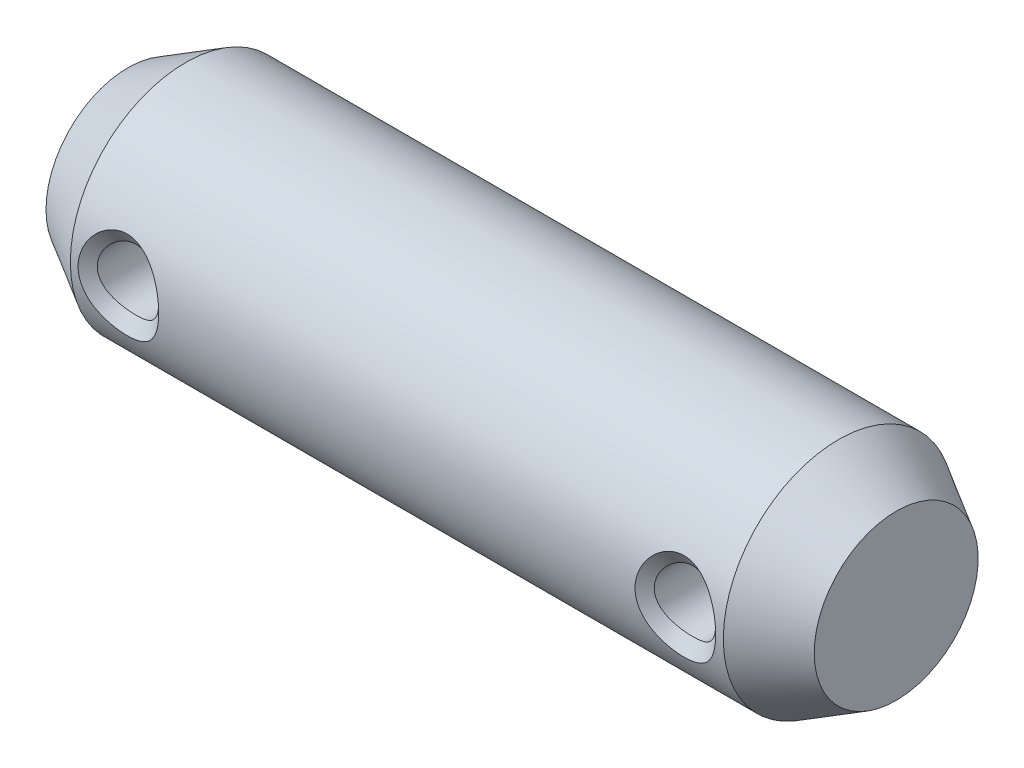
ISO-10303-21;
HEADER;
FILE_DESCRIPTION(('STEP AP214'),'2;1');
FILE_NAME('part.step','',(''),(''),'','','');
FILE_SCHEMA(('AUTOMOTIVE_DESIGN { 1 0 10303 214 1 1 1 1 }'));
ENDSEC;
DATA;
#1=APPLICATION_CONTEXT('core data for automotive mechanical design processes');
#2=APPLICATION_PROTOCOL_DEFINITION('international standard','automotive_design',2000,#1);
#3=PRODUCT_CONTEXT('',#1,'mechanical');
#4=PRODUCT('Part','Part','',(#3));
#5=PRODUCT_RELATED_PRODUCT_CATEGORY('part','',(#4));
#6=PRODUCT_DEFINITION_FORMATION('','',#4);
#7=PRODUCT_DEFINITION_CONTEXT('part definition',#1,'design');
#8=PRODUCT_DEFINITION('design','',#6,#7);
#9=PRODUCT_DEFINITION_SHAPE('','',#8);
#10=(LENGTH_UNIT() NAMED_UNIT(*) SI_UNIT(.MILLI.,.METRE.));
#11=(NAMED_UNIT(*) PLANE_ANGLE_UNIT() SI_UNIT($,.RADIAN.));
#12=(NAMED_UNIT(*) SI_UNIT($,.STERADIAN.) SOLID_ANGLE_UNIT());
#13=UNCERTAINTY_MEASURE_WITH_UNIT(LENGTH_MEASURE(1.E-05),#10,'distance_accuracy_value','');
#14=(GEOMETRIC_REPRESENTATION_CONTEXT(3) GLOBAL_UNCERTAINTY_ASSIGNED_CONTEXT((#13)) GLOBAL_UNIT_ASSIGNED_CONTEXT((#10,
#11,#12)) REPRESENTATION_CONTEXT('',''));
#15=CARTESIAN_POINT('',(0.,0.,0.));
#16=DIRECTION('',(0.,0.,1.));
#17=DIRECTION('',(1.,0.,0.));
#18=AXIS2_PLACEMENT_3D('',#15,#16,#17);
#19=CARTESIAN_POINT('',(40.,4.26794919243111,0.));
#20=DIRECTION('',(1.,0.,0.));
#21=DIRECTION('',(0.,0.,-1.));
#22=AXIS2_PLACEMENT_3D('',#19,#20,#21);
#23=PLANE('',#22);
#24=CARTESIAN_POINT('',(40.,0.,0.));
#25=DIRECTION('',(-1.,0.,0.));
#26=DIRECTION('',(0.,0.,1.));
#27=AXIS2_PLACEMENT_3D('',#24,#25,#26);
#28=CIRCLE('',#27,4.26794919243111);
#29=CARTESIAN_POINT('',(40.,0.,4.26794919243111));
#30=VERTEX_POINT('',#29);
#31=EDGE_CURVE('E65',#30,#30,#28,.T.);
#32=ORIENTED_EDGE('',*,*,#31,.F.);
#33=EDGE_LOOP('',(#32));
#34=FACE_BOUND('',#33,.T.);
#35=ADVANCED_FACE('F22',(#34),#23,.T.);
#36=CARTESIAN_POINT('',(37.,0.,0.));
#37=DIRECTION('',(-1.,0.,0.));
#38=DIRECTION('',(0.,0.,1.));
#39=AXIS2_PLACEMENT_3D('',#36,#37,#38);
#40=CONICAL_SURFACE('',#39,5.99999999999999,0.5235987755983);
#41=ORIENTED_EDGE('',*,*,#31,.T.);
#42=EDGE_LOOP('',(#41));
#43=FACE_BOUND('',#42,.T.);
#44=CARTESIAN_POINT('',(37.,0.,0.));
#45=DIRECTION('',(-1.,0.,0.));
#46=DIRECTION('',(0.,0.,1.));
#47=AXIS2_PLACEMENT_3D('',#44,#45,#46);
#48=CIRCLE('',#47,5.99999999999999);
#49=CARTESIAN_POINT('',(37.,0.,5.99999999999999));
#50=VERTEX_POINT('',#49);
#51=EDGE_CURVE('E70',#50,#50,#48,.T.);
#52=ORIENTED_EDGE('',*,*,#51,.F.);
#53=EDGE_LOOP('',(#52));
#54=FACE_BOUND('',#53,.T.);
#55=ADVANCED_FACE('F123',(#43,#54),#40,.T.);
#56=CARTESIAN_POINT('',(0.,0.,0.));
#57=DIRECTION('',(-1.,0.,0.));
#58=DIRECTION('',(0.,0.,1.));
#59=AXIS2_PLACEMENT_3D('',#56,#57,#58);
#60=CYLINDRICAL_SURFACE('',#59,5.99999999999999);
#61=CARTESIAN_POINT('',(7.59999997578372,0.,5.99999999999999));
#62=CARTESIAN_POINT('',(7.59947805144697,0.608236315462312,5.99981680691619));
#63=CARTESIAN_POINT('',(7.36864523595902,1.20084369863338,5.89668898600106));
#64=CARTESIAN_POINT('',(6.59958250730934,2.04075801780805,5.65718561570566));
#65=CARTESIAN_POINT('',(6.05626060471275,2.29176124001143,5.5450961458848));
#66=CARTESIAN_POINT('',(4.94159028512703,2.2900562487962,5.54575361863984));
#67=CARTESIAN_POINT('',(4.39989649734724,2.03943506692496,5.65753229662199));
#68=CARTESIAN_POINT('',(3.62965243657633,1.19974203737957,5.89702228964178));
#69=CARTESIAN_POINT('',(3.39984643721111,0.605107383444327,6.00008669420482));
#70=CARTESIAN_POINT('',(3.40015477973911,-0.60852517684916,5.99991281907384));
#71=CARTESIAN_POINT('',(3.63010631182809,-1.20072186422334,5.89688683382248));
#72=CARTESIAN_POINT('',(4.39993452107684,-2.03899198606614,5.65751726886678));
#73=CARTESIAN_POINT('',(4.94402219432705,-2.29125271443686,5.54527673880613));
#74=CARTESIAN_POINT('',(6.05920566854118,-2.29056402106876,5.54557333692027));
#75=CARTESIAN_POINT('',(6.5999213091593,-2.03947322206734,5.6573718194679));
#76=CARTESIAN_POINT('',(7.36908378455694,-1.20128117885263,5.89674047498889));
#77=CARTESIAN_POINT('',(7.60052190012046,-0.608236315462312,6.0001831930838));
#78=CARTESIAN_POINT('',(7.59999997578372,0.,5.99999999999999));
#79=B_SPLINE_CURVE_WITH_KNOTS('',3,(#61,#62,#63,#64,#65,#66,#67,#68,#69,#70,#71,#72,#73,#74,#75,
#76,#77,#78),.UNSPECIFIED.,.T.,.F.,(4,2,2,2,2,2,2,2,4),(-0.0131983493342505,-0.0115408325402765,
-0.0098833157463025,-0.00822579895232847,-0.00656828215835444,-0.00491076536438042,
-0.00325324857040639,-0.00159573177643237,6.17850175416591E-05),.UNSPECIFIED.);
#80=CARTESIAN_POINT('',(7.59999997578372,0.,5.99999999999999));
#81=VERTEX_POINT('',#80);
#82=EDGE_CURVE('E35',#81,#81,#79,.F.);
#83=ORIENTED_EDGE('',*,*,#82,.T.);
#84=EDGE_LOOP('',(#83));
#85=FACE_BOUND('',#84,.T.);
#86=CARTESIAN_POINT('',(36.5999999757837,0.,5.99999999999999));
#87=CARTESIAN_POINT('',(36.599478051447,0.608236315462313,5.99981680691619));
#88=CARTESIAN_POINT('',(36.368645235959,1.20084369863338,5.89668898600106));
#89=CARTESIAN_POINT('',(35.5995825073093,2.04075801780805,5.65718561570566));
#90=CARTESIAN_POINT('',(35.0562606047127,2.29176124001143,5.5450961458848));
#91=CARTESIAN_POINT('',(33.941590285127,2.29005624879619,5.54575361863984));
#92=CARTESIAN_POINT('',(33.3998964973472,2.03943506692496,5.65753229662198));
#93=CARTESIAN_POINT('',(32.6296524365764,1.19974203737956,5.89702228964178));
#94=CARTESIAN_POINT('',(32.3998464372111,0.605107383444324,6.00008669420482));
#95=CARTESIAN_POINT('',(32.4001547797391,-0.608525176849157,5.99991281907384));
#96=CARTESIAN_POINT('',(32.6301063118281,-1.20072186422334,5.89688683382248));
#97=CARTESIAN_POINT('',(33.3999345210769,-2.03899198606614,5.65751726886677));
#98=CARTESIAN_POINT('',(33.9440221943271,-2.29125271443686,5.54527673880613));
#99=CARTESIAN_POINT('',(35.0592056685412,-2.29056402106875,5.54557333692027));
#100=CARTESIAN_POINT('',(35.5999213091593,-2.03947322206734,5.65737181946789));
#101=CARTESIAN_POINT('',(36.3690837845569,-1.20128117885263,5.89674047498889));
#102=CARTESIAN_POINT('',(36.6005219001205,-0.608236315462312,6.0001831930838));
#103=CARTESIAN_POINT('',(36.5999999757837,0.,5.99999999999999));
#104=B_SPLINE_CURVE_WITH_KNOTS('',3,(#86,#87,#88,#89,#90,#91,#92,#93,#94,#95,#96,#97,#98,#99,
#100,#101,#102,#103),.UNSPECIFIED.,.T.,.F.,(4,2,2,2,2,2,2,2,4),(-0.0131983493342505,
-0.0115408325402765,-0.00988331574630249,-0.00822579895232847,-0.00656828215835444,
-0.00491076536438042,-0.00325324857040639,-0.00159573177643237,6.17850175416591E-05),.UNSPECIFIED.);
#105=CARTESIAN_POINT('',(36.5999999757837,0.,5.99999999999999));
#106=VERTEX_POINT('',#105);
#107=EDGE_CURVE('E40',#106,#106,#104,.F.);
#108=ORIENTED_EDGE('',*,*,#107,.T.);
#109=EDGE_LOOP('',(#108));
#110=FACE_BOUND('',#109,.T.);
#111=CARTESIAN_POINT('',(7.59999997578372,0.,-5.99999999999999));
#112=CARTESIAN_POINT('',(7.59947805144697,-0.608236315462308,-5.99981680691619));
#113=CARTESIAN_POINT('',(7.36864523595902,-1.20084369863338,-5.89668898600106));
#114=CARTESIAN_POINT('',(6.59958250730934,-2.04075801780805,-5.65718561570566));
#115=CARTESIAN_POINT('',(6.05626060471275,-2.29176124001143,-5.5450961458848));
#116=CARTESIAN_POINT('',(4.94159028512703,-2.2900562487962,-5.54575361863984));
#117=CARTESIAN_POINT('',(4.39989649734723,-2.03943506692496,-5.65753229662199));
#118=CARTESIAN_POINT('',(3.62965243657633,-1.19974203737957,-5.89702228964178));
#119=CARTESIAN_POINT('',(3.39984643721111,-0.605107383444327,-6.00008669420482));
#120=CARTESIAN_POINT('',(3.40015477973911,0.608525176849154,-5.99991281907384));
#121=CARTESIAN_POINT('',(3.63010631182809,1.20072186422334,-5.89688683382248));
#122=CARTESIAN_POINT('',(4.39993452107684,2.03899198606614,-5.65751726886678));
#123=CARTESIAN_POINT('',(4.94402219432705,2.29125271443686,-5.54527673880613));
#124=CARTESIAN_POINT('',(6.05920566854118,2.29056402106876,-5.54557333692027));
#125=CARTESIAN_POINT('',(6.5999213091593,2.03947322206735,-5.65737181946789));
#126=CARTESIAN_POINT('',(7.36908378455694,1.20128117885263,-5.89674047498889));
#127=CARTESIAN_POINT('',(7.60052190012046,0.608236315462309,-6.0001831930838));
#128=CARTESIAN_POINT('',(7.59999997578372,0.,-5.99999999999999));
#129=B_SPLINE_CURVE_WITH_KNOTS('',3,(#111,#112,#113,#114,#115,#116,#117,#118,#119,#120,#121,
#122,#123,#124,#125,#126,#127,#128),.UNSPECIFIED.,.T.,.F.,(4,2,2,2,2,2,2,2,4),
(-0.0131983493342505,-0.0115408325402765,-0.0098833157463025,-0.00822579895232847,
-0.00656828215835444,-0.00491076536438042,-0.00325324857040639,-0.00159573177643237,
6.17850175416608E-05),.UNSPECIFIED.);
#130=CARTESIAN_POINT('',(7.59999997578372,0.,-5.99999999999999));
#131=VERTEX_POINT('',#130);
#132=EDGE_CURVE('E45',#131,#131,#129,.F.);
#133=ORIENTED_EDGE('',*,*,#132,.T.);
#134=EDGE_LOOP('',(#133));
#135=FACE_BOUND('',#134,.T.);
#136=CARTESIAN_POINT('',(36.5999999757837,0.,-5.99999999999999));
#137=CARTESIAN_POINT('',(36.599478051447,-0.608236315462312,-5.99981680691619));
#138=CARTESIAN_POINT('',(36.368645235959,-1.20084369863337,-5.89668898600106));
#139=CARTESIAN_POINT('',(35.5995825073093,-2.04075801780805,-5.65718561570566));
#140=CARTESIAN_POINT('',(35.0562606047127,-2.29176124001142,-5.5450961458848));
#141=CARTESIAN_POINT('',(33.941590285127,-2.29005624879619,-5.54575361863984));
#142=CARTESIAN_POINT('',(33.3998964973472,-2.03943506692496,-5.65753229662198));
#143=CARTESIAN_POINT('',(32.6296524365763,-1.19974203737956,-5.89702228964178));
#144=CARTESIAN_POINT('',(32.3998464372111,-0.605107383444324,-6.00008669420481));
#145=CARTESIAN_POINT('',(32.4001547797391,0.608525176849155,-5.99991281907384));
#146=CARTESIAN_POINT('',(32.6301063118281,1.20072186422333,-5.89688683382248));
#147=CARTESIAN_POINT('',(33.3999345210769,2.03899198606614,-5.65751726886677));
#148=CARTESIAN_POINT('',(33.9440221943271,2.29125271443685,-5.54527673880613));
#149=CARTESIAN_POINT('',(35.0592056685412,2.29056402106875,-5.54557333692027));
#150=CARTESIAN_POINT('',(35.5999213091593,2.03947322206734,-5.65737181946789));
#151=CARTESIAN_POINT('',(36.3690837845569,1.20128117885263,-5.89674047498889));
#152=CARTESIAN_POINT('',(36.6005219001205,0.608236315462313,-6.0001831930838));
#153=CARTESIAN_POINT('',(36.5999999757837,0.,-5.99999999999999));
#154=B_SPLINE_CURVE_WITH_KNOTS('',3,(#136,#137,#138,#139,#140,#141,#142,#143,#144,#145,#146,
#147,#148,#149,#150,#151,#152,#153),.UNSPECIFIED.,.T.,.F.,(4,2,2,2,2,2,2,2,4),
(-0.0131983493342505,-0.0115408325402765,-0.00988331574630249,-0.00822579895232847,
-0.00656828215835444,-0.00491076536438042,-0.00325324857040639,-0.00159573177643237,
6.17850175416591E-05),.UNSPECIFIED.);
#155=CARTESIAN_POINT('',(36.5999999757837,0.,-5.99999999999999));
#156=VERTEX_POINT('',#155);
#157=EDGE_CURVE('E50',#156,#156,#154,.F.);
#158=ORIENTED_EDGE('',*,*,#157,.T.);
#159=EDGE_LOOP('',(#158));
#160=FACE_BOUND('',#159,.T.);
#161=ORIENTED_EDGE('',*,*,#51,.T.);
#162=EDGE_LOOP('',(#161));
#163=FACE_BOUND('',#162,.T.);
#164=CARTESIAN_POINT('',(3.,0.,0.));
#165=DIRECTION('',(-1.,0.,0.));
#166=DIRECTION('',(0.,0.,1.));
#167=AXIS2_PLACEMENT_3D('',#164,#165,#166);
#168=CIRCLE('',#167,5.99999999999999);
#169=CARTESIAN_POINT('',(3.,0.,5.99999999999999));
#170=VERTEX_POINT('',#169);
#171=EDGE_CURVE('E75',#170,#170,#168,.T.);
#172=ORIENTED_EDGE('',*,*,#171,.F.);
#173=EDGE_LOOP('',(#172));
#174=FACE_BOUND('',#173,.T.);
#175=ADVANCED_FACE('F113',(#85,#110,#135,#160,#163,#174),#60,.T.);
#176=CARTESIAN_POINT('',(0.,0.,0.));
#177=DIRECTION('',(1.,0.,0.));
#178=DIRECTION('',(0.,0.,-1.));
#179=AXIS2_PLACEMENT_3D('',#176,#177,#178);
#180=CONICAL_SURFACE('',#179,4.26794919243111,0.523598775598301);
#181=ORIENTED_EDGE('',*,*,#171,.T.);
#182=EDGE_LOOP('',(#181));
#183=FACE_BOUND('',#182,.T.);
#184=CARTESIAN_POINT('',(0.,0.,0.));
#185=DIRECTION('',(-1.,0.,0.));
#186=DIRECTION('',(0.,0.,1.));
#187=AXIS2_PLACEMENT_3D('',#184,#185,#186);
#188=CIRCLE('',#187,4.26794919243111);
#189=CARTESIAN_POINT('',(0.,0.,4.26794919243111));
#190=VERTEX_POINT('',#189);
#191=EDGE_CURVE('E170',#190,#190,#188,.T.);
#192=ORIENTED_EDGE('',*,*,#191,.F.);
#193=EDGE_LOOP('',(#192));
#194=FACE_BOUND('',#193,.T.);
#195=ADVANCED_FACE('F122',(#183,#194),#180,.T.);
#196=CARTESIAN_POINT('',(0.,0.,0.));
#197=DIRECTION('',(-1.,0.,0.));
#198=DIRECTION('',(0.,0.,1.));
#199=AXIS2_PLACEMENT_3D('',#196,#197,#198);
#200=PLANE('',#199);
#201=ORIENTED_EDGE('',*,*,#191,.T.);
#202=EDGE_LOOP('',(#201));
#203=FACE_BOUND('',#202,.T.);
#204=ADVANCED_FACE('F305',(#203),#200,.T.);
#205=CARTESIAN_POINT('',(34.5,0.,-6.));
#206=DIRECTION('',(0.,0.,1.));
#207=DIRECTION('',(1.,0.,0.));
#208=AXIS2_PLACEMENT_3D('',#205,#206,#207);
#209=CYLINDRICAL_SURFACE('',#208,1.6);
#210=CARTESIAN_POINT('',(36.1,0.,5.50000004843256));
#211=CARTESIAN_POINT('',(36.1000259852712,-0.0265152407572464,5.50001118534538));
#212=CARTESIAN_POINT('',(36.0993611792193,-0.0530290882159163,5.49965096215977));
#213=CARTESIAN_POINT('',(36.0966776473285,-0.10591945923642,5.49822622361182));
#214=CARTESIAN_POINT('',(36.0946614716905,-0.132296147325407,5.49716303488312));
#215=CARTESIAN_POINT('',(36.0893049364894,-0.184856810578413,5.49437168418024));
#216=CARTESIAN_POINT('',(36.085965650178,-0.211040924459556,5.49264406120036));
#217=CARTESIAN_POINT('',(36.0779939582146,-0.263162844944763,5.48856387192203));
#218=CARTESIAN_POINT('',(36.0733615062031,-0.289100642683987,5.48621128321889));
#219=CARTESIAN_POINT('',(36.0628337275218,-0.340676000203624,5.48092071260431));
#220=CARTESIAN_POINT('',(36.0569375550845,-0.366313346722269,5.47798233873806));
#221=CARTESIAN_POINT('',(36.0439123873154,-0.417234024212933,5.47155963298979));
#222=CARTESIAN_POINT('',(36.0367820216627,-0.442516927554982,5.46807469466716));
#223=CARTESIAN_POINT('',(36.02131821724,-0.492674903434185,5.46059813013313));
#224=CARTESIAN_POINT('',(36.0129831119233,-0.517549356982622,5.45660580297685));
#225=CARTESIAN_POINT('',(35.9951393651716,-0.566836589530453,5.44815362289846));
#226=CARTESIAN_POINT('',(35.9856289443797,-0.591248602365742,5.44369306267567));
#227=CARTESIAN_POINT('',(35.9654639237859,-0.639557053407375,5.43434349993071));
#228=CARTESIAN_POINT('',(35.9548075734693,-0.663452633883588,5.42945384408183));
#229=CARTESIAN_POINT('',(35.9323799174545,-0.710674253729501,5.41928510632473));
#230=CARTESIAN_POINT('',(35.9206069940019,-0.733999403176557,5.41400546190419));
#231=CARTESIAN_POINT('',(35.8959753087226,-0.780026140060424,5.40309578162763));
#232=CARTESIAN_POINT('',(35.8831151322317,-0.802726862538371,5.39746529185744));
#233=CARTESIAN_POINT('',(35.8563380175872,-0.84745062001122,5.38589275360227));
#234=CARTESIAN_POINT('',(35.8424199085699,-0.869472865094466,5.37995036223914));
#235=CARTESIAN_POINT('',(35.8135558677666,-0.912785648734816,5.36779355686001));
#236=CARTESIAN_POINT('',(35.798609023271,-0.934075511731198,5.36157890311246));
#237=CARTESIAN_POINT('',(35.7677168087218,-0.975868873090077,5.34891449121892));
#238=CARTESIAN_POINT('',(35.7517707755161,-0.996371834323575,5.3424645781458));
#239=CARTESIAN_POINT('',(35.7189081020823,-1.03653894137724,5.32937640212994));
#240=CARTESIAN_POINT('',(35.7019910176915,-1.05620269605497,5.32273805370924));
#241=CARTESIAN_POINT('',(35.6672193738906,-1.09463059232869,5.30928310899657));
#242=CARTESIAN_POINT('',(35.6493645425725,-1.11339446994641,5.30246646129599));
#243=CARTESIAN_POINT('',(35.6127347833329,-1.14998942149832,5.28880330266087));
#244=CARTESIAN_POINT('',(35.5939598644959,-1.16782050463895,5.28195679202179));
#245=CARTESIAN_POINT('',(35.5555291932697,-1.2025426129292,5.26838958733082));
#246=CARTESIAN_POINT('',(35.5358737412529,-1.21943395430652,5.26166885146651));
#247=CARTESIAN_POINT('',(35.4957377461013,-1.25224164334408,5.24837071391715));
#248=CARTESIAN_POINT('',(35.4752576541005,-1.26815851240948,5.24179323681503));
#249=CARTESIAN_POINT('',(35.4335228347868,-1.2989906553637,5.22883583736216));
#250=CARTESIAN_POINT('',(35.4122687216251,-1.31390669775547,5.22245576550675));
#251=CARTESIAN_POINT('',(35.3690377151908,-1.34270828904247,5.20993760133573));
#252=CARTESIAN_POINT('',(35.3470615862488,-1.35659488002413,5.20379926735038));
#253=CARTESIAN_POINT('',(35.302438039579,-1.38330924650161,5.19181165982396));
#254=CARTESIAN_POINT('',(35.2797915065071,-1.39613833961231,5.18596203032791));
#255=CARTESIAN_POINT('',(35.2338787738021,-1.42070922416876,5.17459822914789));
#256=CARTESIAN_POINT('',(35.2106135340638,-1.43245258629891,5.16908357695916));
#257=CARTESIAN_POINT('',(35.1635150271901,-1.45482358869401,5.15843632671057));
#258=CARTESIAN_POINT('',(35.1396827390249,-1.46545300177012,5.15330312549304));
#259=CARTESIAN_POINT('',(35.0915018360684,-1.48556772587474,5.14346531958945));
#260=CARTESIAN_POINT('',(35.0671541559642,-1.49505492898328,5.13876000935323));
#261=CARTESIAN_POINT('',(35.0179942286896,-1.51285694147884,5.12982451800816));
#262=CARTESIAN_POINT('',(34.9931828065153,-1.52117364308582,5.12559357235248));
#263=CARTESIAN_POINT('',(34.9431472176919,-1.53660647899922,5.11765329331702));
#264=CARTESIAN_POINT('',(34.9179237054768,-1.54372434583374,5.11394320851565));
#265=CARTESIAN_POINT('',(34.8671158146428,-1.55673151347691,5.10709105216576));
#266=CARTESIAN_POINT('',(34.8415318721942,-1.56262218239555,5.10394834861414));
#267=CARTESIAN_POINT('',(34.7900550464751,-1.57314712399,5.09827726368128));
#268=CARTESIAN_POINT('',(34.7641623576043,-1.57778214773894,5.09574851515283));
#269=CARTESIAN_POINT('',(34.7121199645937,-1.58576837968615,5.09135141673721));
#270=CARTESIAN_POINT('',(34.6859702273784,-1.58911942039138,5.08948315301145));
#271=CARTESIAN_POINT('',(34.6334657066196,-1.59451000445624,5.08645319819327));
#272=CARTESIAN_POINT('',(34.6071107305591,-1.59654811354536,5.08529227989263));
#273=CARTESIAN_POINT('',(34.5542473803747,-1.59928763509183,5.08372184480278));
#274=CARTESIAN_POINT('',(34.527738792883,-1.59998596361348,5.0833140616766));
#275=CARTESIAN_POINT('',(34.4747117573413,-1.6000130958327,5.08329859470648));
#276=CARTESIAN_POINT('',(34.4481933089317,-1.59934144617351,5.0836911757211));
#277=CARTESIAN_POINT('',(34.3952926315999,-1.59664436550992,5.08523685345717));
#278=CARTESIAN_POINT('',(34.3689102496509,-1.5946211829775,5.08638868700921));
#279=CARTESIAN_POINT('',(34.3163355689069,-1.5892538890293,5.08940388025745));
#280=CARTESIAN_POINT('',(34.2901431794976,-1.58591045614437,5.09126687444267));
#281=CARTESIAN_POINT('',(34.2380024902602,-1.57793289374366,5.09565685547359));
#282=CARTESIAN_POINT('',(34.2120542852,-1.5732982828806,5.09818408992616));
#283=CARTESIAN_POINT('',(34.1604557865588,-1.56276877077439,5.10385498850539));
#284=CARTESIAN_POINT('',(34.1348058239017,-1.55687258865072,5.10699927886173));
#285=CARTESIAN_POINT('',(34.0838576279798,-1.54384982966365,5.11385703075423));
#286=CARTESIAN_POINT('',(34.0585599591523,-1.53672147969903,5.11757131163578));
#287=CARTESIAN_POINT('',(34.008370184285,-1.52126402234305,5.12552193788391));
#288=CARTESIAN_POINT('',(33.9834788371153,-1.51293290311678,5.12975915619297));
#289=CARTESIAN_POINT('',(33.9341555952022,-1.49509928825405,5.13870868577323));
#290=CARTESIAN_POINT('',(33.9097245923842,-1.48559474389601,5.1434218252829));
#291=CARTESIAN_POINT('',(33.8613760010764,-1.46544346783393,5.15327630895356));
#292=CARTESIAN_POINT('',(33.8374593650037,-1.45479480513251,5.15841837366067));
#293=CARTESIAN_POINT('',(33.7901935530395,-1.43238433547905,5.1690838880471));
#294=CARTESIAN_POINT('',(33.7668453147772,-1.42062082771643,5.17460791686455));
#295=CARTESIAN_POINT('',(33.7207704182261,-1.39600959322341,5.18599051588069));
#296=CARTESIAN_POINT('',(33.6980446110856,-1.38316047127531,5.19184951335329));
#297=CARTESIAN_POINT('',(33.6532688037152,-1.35640690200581,5.20385540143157));
#298=CARTESIAN_POINT('',(33.6312195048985,-1.34250140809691,5.21000257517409));
#299=CARTESIAN_POINT('',(33.587850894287,-1.31366379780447,5.22253744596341));
#300=CARTESIAN_POINT('',(33.5665320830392,-1.29873099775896,5.22892530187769));
#301=CARTESIAN_POINT('',(33.5246791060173,-1.26786802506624,5.24189679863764));
#302=CARTESIAN_POINT('',(33.5041452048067,-1.25193752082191,5.24848050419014));
#303=CARTESIAN_POINT('',(33.4639151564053,-1.21910630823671,5.26178902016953));
#304=CARTESIAN_POINT('',(33.4442190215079,-1.20220558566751,5.26851383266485));
#305=CARTESIAN_POINT('',(33.4057235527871,-1.16746894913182,5.28208684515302));
#306=CARTESIAN_POINT('',(33.3869239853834,-1.14963328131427,5.28893501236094));
#307=CARTESIAN_POINT('',(33.3502596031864,-1.11303368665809,5.30259858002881));
#308=CARTESIAN_POINT('',(33.3323943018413,-1.09427025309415,5.3094139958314));
#309=CARTESIAN_POINT('',(33.2976110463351,-1.0558479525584,5.3228637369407));
#310=CARTESIAN_POINT('',(33.2806924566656,-1.03618970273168,5.32949818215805));
#311=CARTESIAN_POINT('',(33.2478351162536,-0.99603782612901,5.34257652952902));
#312=CARTESIAN_POINT('',(33.231895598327,-0.975544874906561,5.34902057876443));
#313=CARTESIAN_POINT('',(33.2010230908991,-0.933775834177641,5.36167167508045));
#314=CARTESIAN_POINT('',(33.1860891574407,-0.912500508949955,5.3678789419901));
#315=CARTESIAN_POINT('',(33.1572561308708,-0.869221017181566,5.38001989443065));
#316=CARTESIAN_POINT('',(33.1433558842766,-0.847217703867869,5.38595388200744));
#317=CARTESIAN_POINT('',(33.1166181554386,-0.802535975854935,5.39750902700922));
#318=CARTESIAN_POINT('',(33.1037792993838,-0.779858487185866,5.40313058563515));
#319=CARTESIAN_POINT('',(33.0791924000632,-0.733882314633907,5.41402231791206));
#320=CARTESIAN_POINT('',(33.0674427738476,-0.71058459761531,5.41929299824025));
#321=CARTESIAN_POINT('',(33.0450623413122,-0.663421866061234,5.42944422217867));
#322=CARTESIAN_POINT('',(33.0344297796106,-0.639557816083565,5.43432537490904));
#323=CARTESIAN_POINT('',(33.0143114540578,-0.591316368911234,5.4436588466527));
#324=CARTESIAN_POINT('',(33.0048238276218,-0.566939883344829,5.44811185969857));
#325=CARTESIAN_POINT('',(32.9870232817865,-0.517727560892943,5.45655036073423));
#326=CARTESIAN_POINT('',(32.978708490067,-0.492892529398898,5.46053659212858));
#327=CARTESIAN_POINT('',(32.9632814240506,-0.442817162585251,5.46800287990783));
#328=CARTESIAN_POINT('',(32.956167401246,-0.417577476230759,5.4714836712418));
#329=CARTESIAN_POINT('',(32.9431695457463,-0.3667468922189,5.4779004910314));
#330=CARTESIAN_POINT('',(32.937284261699,-0.341156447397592,5.48083716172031));
#331=CARTESIAN_POINT('',(32.926771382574,-0.289678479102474,5.48612723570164));
#332=CARTESIAN_POINT('',(32.9221428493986,-0.263791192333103,5.48848107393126));
#333=CARTESIAN_POINT('',(32.9141707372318,-0.211773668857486,5.49256712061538));
#334=CARTESIAN_POINT('',(32.9108269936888,-0.185643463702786,5.49429940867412));
#335=CARTESIAN_POINT('',(32.9054515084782,-0.133194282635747,5.49710406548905));
#336=CARTESIAN_POINT('',(32.9034206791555,-0.106875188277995,5.49817597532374));
#337=CARTESIAN_POINT('',(32.9006975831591,-0.0541020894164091,5.49962208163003));
#338=CARTESIAN_POINT('',(32.9000076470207,-0.0276479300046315,5.49999506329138));
#339=CARTESIAN_POINT('',(32.8999932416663,0.0252668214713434,5.5000045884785));
#340=CARTESIAN_POINT('',(32.900669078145,0.0517274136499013,5.49964096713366));
#341=CARTESIAN_POINT('',(32.9033646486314,0.10452526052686,5.49821207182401));
#342=CARTESIAN_POINT('',(32.9053826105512,0.130862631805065,5.49714772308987));
#343=CARTESIAN_POINT('',(32.9107328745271,0.183358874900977,5.49435721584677));
#344=CARTESIAN_POINT('',(32.9140647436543,0.209517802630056,5.49263127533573));
#345=CARTESIAN_POINT('',(32.9220138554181,0.261601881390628,5.48855685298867));
#346=CARTESIAN_POINT('',(32.9266316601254,0.287526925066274,5.48620809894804));
#347=CARTESIAN_POINT('',(32.9371239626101,0.339088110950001,5.48092719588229));
#348=CARTESIAN_POINT('',(32.9429997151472,0.364723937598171,5.47799446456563));
#349=CARTESIAN_POINT('',(32.955979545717,0.415651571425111,5.47158455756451));
#350=CARTESIAN_POINT('',(32.9630853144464,0.440942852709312,5.46810663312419));
#351=CARTESIAN_POINT('',(32.9784970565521,0.491126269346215,5.46064516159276));
#352=CARTESIAN_POINT('',(32.9868049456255,0.51601769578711,5.45666080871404));
#353=CARTESIAN_POINT('',(33.004593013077,0.565346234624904,5.44822519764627));
#354=CARTESIAN_POINT('',(33.0140751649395,0.589782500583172,5.4437731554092));
#355=CARTESIAN_POINT('',(33.0341840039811,0.63814549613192,5.43444081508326));
#356=CARTESIAN_POINT('',(33.0448125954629,0.662071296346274,5.42955980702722));
#357=CARTESIAN_POINT('',(33.0671866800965,0.709358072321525,5.419408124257));
#358=CARTESIAN_POINT('',(33.0789339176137,0.732718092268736,5.41413684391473));
#359=CARTESIAN_POINT('',(33.10351775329,0.778817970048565,5.40324323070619));
#360=CARTESIAN_POINT('',(33.116355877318,0.801556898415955,5.39762040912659));
#361=CARTESIAN_POINT('',(33.1430939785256,0.846359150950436,5.38606212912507));
#362=CARTESIAN_POINT('',(33.156995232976,0.868421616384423,5.38012629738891));
#363=CARTESIAN_POINT('',(33.1858321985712,0.911815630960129,5.36798112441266));
#364=CARTESIAN_POINT('',(33.2007689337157,0.933146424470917,5.36177151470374));
#365=CARTESIAN_POINT('',(33.2316491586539,0.975021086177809,5.34911527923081));
#366=CARTESIAN_POINT('',(33.247593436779,0.995564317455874,5.342668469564));
#367=CARTESIAN_POINT('',(33.2804621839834,1.03581030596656,5.32958423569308));
#368=CARTESIAN_POINT('',(33.2973872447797,1.05551254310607,5.32294669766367));
#369=CARTESIAN_POINT('',(33.3321866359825,1.09401374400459,5.30949048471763));
#370=CARTESIAN_POINT('',(33.3500614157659,1.11281227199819,5.30267172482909));
#371=CARTESIAN_POINT('',(33.3867385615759,1.14947101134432,5.28900310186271));
#372=CARTESIAN_POINT('',(33.4055409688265,1.16733118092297,5.28215323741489));
#373=CARTESIAN_POINT('',(33.4440281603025,1.2021060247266,5.26857996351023));
#374=CARTESIAN_POINT('',(33.4637125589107,1.2190211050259,5.26185650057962));
#375=CARTESIAN_POINT('',(33.5039080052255,1.25187085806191,5.24855320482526));
#376=CARTESIAN_POINT('',(33.524418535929,1.26780612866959,5.24197328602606));
#377=CARTESIAN_POINT('',(33.5662149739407,1.2986706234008,5.22901123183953));
#378=CARTESIAN_POINT('',(33.5875002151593,1.31360068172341,5.22262893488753));
#379=CARTESIAN_POINT('',(33.6307936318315,1.34242656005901,5.21010640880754));
#380=CARTESIAN_POINT('',(33.65280100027,1.35632348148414,5.20396592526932));
#381=CARTESIAN_POINT('',(33.6974865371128,1.38305553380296,5.19197398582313));
#382=CARTESIAN_POINT('',(33.7201637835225,1.39589203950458,5.18612215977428));
#383=CARTESIAN_POINT('',(33.7661368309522,1.42047552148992,5.17475380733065));
#384=CARTESIAN_POINT('',(33.7894316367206,1.43222412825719,5.16923678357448));
#385=CARTESIAN_POINT('',(33.8365875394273,1.45460413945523,5.15858450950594));
#386=CARTESIAN_POINT('',(33.8604476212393,1.46523738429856,5.15344863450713));
#387=CARTESIAN_POINT('',(33.9086817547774,1.48535903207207,5.1436050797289));
#388=CARTESIAN_POINT('',(33.9330548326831,1.49484940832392,5.13889666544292));
#389=CARTESIAN_POINT('',(33.9822625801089,1.51265776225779,5.12995444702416));
#390=CARTESIAN_POINT('',(34.0070963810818,1.52097773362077,5.12571983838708));
#391=CARTESIAN_POINT('',(34.0571731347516,1.53641783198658,5.11777160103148));
#392=CARTESIAN_POINT('',(34.0824153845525,1.54353982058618,5.1140571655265));
#393=CARTESIAN_POINT('',(34.1332565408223,1.55655667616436,5.10719556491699));
#394=CARTESIAN_POINT('',(34.1588549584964,1.56245307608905,5.10404769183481));
#395=CARTESIAN_POINT('',(34.210355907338,1.5729916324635,5.0983654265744));
#396=CARTESIAN_POINT('',(34.236258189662,1.57763474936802,5.09583056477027));
#397=CARTESIAN_POINT('',(34.2883143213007,1.58564003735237,5.09142028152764));
#398=CARTESIAN_POINT('',(34.3144681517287,1.58900230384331,5.0895448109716));
#399=CARTESIAN_POINT('',(34.3669747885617,1.59441885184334,5.0864994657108));
#400=CARTESIAN_POINT('',(34.3933277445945,1.59647202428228,5.08533018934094));
#401=CARTESIAN_POINT('',(34.4461803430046,1.59924606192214,5.0837417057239));
#402=CARTESIAN_POINT('',(34.4726801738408,1.59996423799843,5.08332401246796));
#403=CARTESIAN_POINT('',(34.5256847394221,1.60003534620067,5.08328835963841));
#404=CARTESIAN_POINT('',(34.5521894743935,1.59938815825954,5.08367047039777));
#405=CARTESIAN_POINT('',(34.6050600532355,1.59674274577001,5.08519585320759));
#406=CARTESIAN_POINT('',(34.6314260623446,1.59474699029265,5.08633773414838));
#407=CARTESIAN_POINT('',(34.6839656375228,1.58943652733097,5.08933346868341));
#408=CARTESIAN_POINT('',(34.7101393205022,1.5861227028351,5.09118684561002));
#409=CARTESIAN_POINT('',(34.7622405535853,1.57820533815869,5.09555817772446));
#410=CARTESIAN_POINT('',(34.7881680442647,1.57360149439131,5.09807628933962));
#411=CARTESIAN_POINT('',(34.839723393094,1.56313357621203,5.10372957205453));
#412=CARTESIAN_POINT('',(34.8653509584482,1.55726836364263,5.1068653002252));
#413=CARTESIAN_POINT('',(34.9162529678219,1.54430667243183,5.11370662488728));
#414=CARTESIAN_POINT('',(34.9415268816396,1.53720852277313,5.11741299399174));
#415=CARTESIAN_POINT('',(34.9916680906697,1.52180967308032,5.12534855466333));
#416=CARTESIAN_POINT('',(35.0165346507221,1.51350701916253,5.12957859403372));
#417=CARTESIAN_POINT('',(35.0658076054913,1.4957276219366,5.13851458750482));
#418=CARTESIAN_POINT('',(35.0902131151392,1.48624884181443,5.14322136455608));
#419=CARTESIAN_POINT('',(35.1385103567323,1.46614546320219,5.15306401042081));
#420=CARTESIAN_POINT('',(35.162401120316,1.45551889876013,5.15820061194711));
#421=CARTESIAN_POINT('',(35.2096151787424,1.43314807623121,5.16885615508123));
#422=CARTESIAN_POINT('',(35.2329374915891,1.42140203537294,5.17437570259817));
#423=CARTESIAN_POINT('',(35.2789608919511,1.39682026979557,5.18575036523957));
#424=CARTESIAN_POINT('',(35.3016610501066,1.38398302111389,5.19160594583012));
#425=CARTESIAN_POINT('',(35.3463862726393,1.35724680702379,5.20360610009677));
#426=CARTESIAN_POINT('',(35.3684105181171,1.34334661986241,5.20975100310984));
#427=CARTESIAN_POINT('',(35.4117301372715,1.31451234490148,5.22228251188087));
#428=CARTESIAN_POINT('',(35.4330248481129,1.2995773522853,5.22866932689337));
#429=CARTESIAN_POINT('',(35.4748310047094,1.26870167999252,5.24163999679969));
#430=CARTESIAN_POINT('',(35.4953419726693,1.25276040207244,5.24822396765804));
#431=CARTESIAN_POINT('',(35.5355283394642,1.21989884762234,5.26153437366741));
#432=CARTESIAN_POINT('',(35.5552034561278,1.20297824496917,5.26826085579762));
#433=CARTESIAN_POINT('',(35.5936578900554,1.1681904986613,5.28183859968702));
#434=CARTESIAN_POINT('',(35.6124371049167,1.15032324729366,5.28868987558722));
#435=CARTESIAN_POINT('',(35.6490657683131,1.11365660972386,5.30236044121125));
#436=CARTESIAN_POINT('',(35.6669154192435,1.09485742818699,5.30917973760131));
#437=CARTESIAN_POINT('',(35.701675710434,1.05636681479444,5.32263754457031));
#438=CARTESIAN_POINT('',(35.7185868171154,1.03667583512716,5.32927614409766));
#439=CARTESIAN_POINT('',(35.7514352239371,0.996459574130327,5.34236303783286));
#440=CARTESIAN_POINT('',(35.767373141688,0.97593483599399,5.34881145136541));
#441=CARTESIAN_POINT('',(35.7982482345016,0.934103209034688,5.36147150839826));
#442=CARTESIAN_POINT('',(35.8131862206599,0.912796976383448,5.36768334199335));
#443=CARTESIAN_POINT('',(35.8420323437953,0.869456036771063,5.37983363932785));
#444=CARTESIAN_POINT('',(35.855941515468,0.84742209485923,5.3857723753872));
#445=CARTESIAN_POINT('',(35.882701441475,0.802679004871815,5.39733721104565));
#446=CARTESIAN_POINT('',(35.895553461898,0.779970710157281,5.40296368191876));
#447=CARTESIAN_POINT('',(35.9201703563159,0.733932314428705,5.4138654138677));
#448=CARTESIAN_POINT('',(35.9319367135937,0.710603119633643,5.41914115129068));
#449=CARTESIAN_POINT('',(35.9543536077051,0.663376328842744,5.42930264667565));
#450=CARTESIAN_POINT('',(35.9650058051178,0.639479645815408,5.43418898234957));
#451=CARTESIAN_POINT('',(35.9851657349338,0.591171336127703,5.44353296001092));
#452=CARTESIAN_POINT('',(35.9946752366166,0.56676057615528,5.4479912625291));
#453=CARTESIAN_POINT('',(36.0125212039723,0.517477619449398,5.45644046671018));
#454=CARTESIAN_POINT('',(36.0208594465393,0.492606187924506,5.46043207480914));
#455=CARTESIAN_POINT('',(36.0363344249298,0.442455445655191,5.46790922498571));
#456=CARTESIAN_POINT('',(36.043472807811,0.41717674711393,5.47139545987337));
#457=CARTESIAN_POINT('',(36.0565197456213,0.366265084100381,5.47782326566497));
#458=CARTESIAN_POINT('',(36.0624296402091,0.340632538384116,5.48076542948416));
#459=CARTESIAN_POINT('',(36.0729914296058,0.28906680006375,5.48606656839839));
#460=CARTESIAN_POINT('',(36.0776441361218,0.263133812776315,5.48842591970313));
#461=CARTESIAN_POINT('',(36.0856637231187,0.211020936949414,5.49252309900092));
#462=CARTESIAN_POINT('',(36.0890306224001,0.18484105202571,5.49426093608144));
#463=CARTESIAN_POINT('',(36.0944505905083,0.132287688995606,5.49707665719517));
#464=CARTESIAN_POINT('',(36.0965025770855,0.105914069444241,5.49815399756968));
#465=CARTESIAN_POINT('',(36.099266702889,0.0530280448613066,5.4996114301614));
#466=CARTESIAN_POINT('',(36.0999763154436,0.026515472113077,5.4999902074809));
#467=CARTESIAN_POINT('',(36.1,0.,5.50000004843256));
#468=B_SPLINE_CURVE_WITH_KNOTS('',3,(#210,#211,#212,#213,#214,#215,#216,#217,#218,#219,#220,
#221,#222,#223,#224,#225,#226,#227,#228,#229,#230,#231,#232,#233,#234,#235,#236,#237,#238,#239,
#240,#241,#242,#243,#244,#245,#246,#247,#248,#249,#250,#251,#252,#253,#254,#255,#256,#257,#258,
#259,#260,#261,#262,#263,#264,#265,#266,#267,#268,#269,#270,#271,#272,#273,#274,#275,#276,#277,
#278,#279,#280,#281,#282,#283,#284,#285,#286,#287,#288,#289,#290,#291,#292,#293,#294,#295,#296,
#297,#298,#299,#300,#301,#302,#303,#304,#305,#306,#307,#308,#309,#310,#311,#312,#313,#314,#315,
#316,#317,#318,#319,#320,#321,#322,#323,#324,#325,#326,#327,#328,#329,#330,#331,#332,#333,#334,
#335,#336,#337,#338,#339,#340,#341,#342,#343,#344,#345,#346,#347,#348,#349,#350,#351,#352,#353,
#354,#355,#356,#357,#358,#359,#360,#361,#362,#363,#364,#365,#366,#367,#368,#369,#370,#371,#372,
#373,#374,#375,#376,#377,#378,#379,#380,#381,#382,#383,#384,#385,#386,#387,#388,#389,#390,#391,
#392,#393,#394,#395,#396,#397,#398,#399,#400,#401,#402,#403,#404,#405,#406,#407,#408,#409,#410,
#411,#412,#413,#414,#415,#416,#417,#418,#419,#420,#421,#422,#423,#424,#425,#426,#427,#428,#429,
#430,#431,#432,#433,#434,#435,#436,#437,#438,#439,#440,#441,#442,#443,#444,#445,#446,#447,#448,
#449,#450,#451,#452,#453,#454,#455,#456,#457,#458,#459,#460,#461,#462,#463,#464,#465,#466,#467),
.UNSPECIFIED.,.F.,.F.,(4,2,2,2,2,2,2,2,2,2,2,2,2,2,2,2,2,2,2,2,2,2,2,2,2,2,2,2,2,2,2,2,2,2,2,2,
2,2,2,2,2,2,2,2,2,2,2,2,2,2,2,2,2,2,2,2,2,2,2,2,2,2,2,2,2,2,2,2,2,2,2,2,2,2,2,2,2,2,2,2,2,2,2,2,
2,2,2,2,2,2,2,2,2,2,2,2,2,2,2,2,2,2,2,2,2,2,2,2,2,2,2,2,2,2,2,2,2,2,2,2,2,2,2,2,2,2,2,2,4),(0.,
0.0795309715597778,0.158912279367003,0.238229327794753,0.31754922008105,0.39692236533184,
0.476384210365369,0.55595704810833,0.635651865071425,0.715470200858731,0.795406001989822,
0.875447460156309,0.95557883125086,1.03578223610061,1.11603944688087,1.19633366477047,
1.27665129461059,1.35696813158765,1.43725777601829,1.51750407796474,1.59768803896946,
1.67778969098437,1.75778998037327,1.83767266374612,1.91742622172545,1.99704579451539,
2.07653513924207,2.15590860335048,2.23519310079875,2.31443006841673,2.39367736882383,
2.47301109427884,2.55252721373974,2.63206965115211,2.71148008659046,2.79084976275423,
2.87024906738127,2.94972937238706,3.02932501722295,3.10905537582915,3.18892696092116,
3.26893553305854,3.34906819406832,3.42930545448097,3.50962327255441,3.58999506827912,
3.67039371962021,3.75079355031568,3.83117231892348,3.91150880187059,3.9917906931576,
4.0720088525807,4.15215062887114,4.23220159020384,4.31214726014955,4.39197486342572,
4.47167508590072,4.55124385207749,4.63068412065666,4.71000769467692,4.78923703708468,
4.86840707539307,4.94756697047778,5.02678181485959,5.10613421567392,5.18550437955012,
5.26476995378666,5.34400943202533,5.42328359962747,5.50263721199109,5.58210077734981,
5.66169239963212,5.74141964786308,5.82128142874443,5.90126984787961,5.98137205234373,
6.06157205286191,6.14185252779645,6.22219661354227,6.30258968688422,6.3830211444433,
6.46345617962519,6.54385638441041,6.62420703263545,6.70449015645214,6.78468642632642,
6.86477703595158,6.94474559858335,7.02458006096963,7.10427463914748,7.18383177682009,
7.26326412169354,7.34259650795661,7.42186792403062,7.50113343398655,7.58046600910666,
7.65995821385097,7.7394574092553,7.81881144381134,7.89811240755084,7.97743204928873,
8.05682356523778,8.13632353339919,8.21595393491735,8.29572421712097,8.37563336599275,
8.45567196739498,8.53582424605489,8.61607007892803,8.69638698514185,8.77675209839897,
8.85714412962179,8.93754532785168,9.0179289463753,9.09827225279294,9.1785640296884,
9.25878986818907,9.3389338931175,9.41898049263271,9.49891605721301,9.57873073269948,
9.65842019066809,9.73798741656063,9.81744451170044,9.89681449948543,9.97613311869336,
10.0554505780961,10.1348332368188,10.2143651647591),.UNSPECIFIED.);
#469=CARTESIAN_POINT('',(36.1,0.,5.50000004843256));
#470=VERTEX_POINT('',#469);
#471=EDGE_CURVE('E10',#470,#470,#468,.F.);
#472=ORIENTED_EDGE('',*,*,#471,.T.);
#473=EDGE_LOOP('',(#472));
#474=FACE_BOUND('',#473,.T.);
#475=CARTESIAN_POINT('',(36.1,0.,-5.50000004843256));
#476=CARTESIAN_POINT('',(36.1000259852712,0.026515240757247,-5.50001118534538));
#477=CARTESIAN_POINT('',(36.0993611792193,0.0530290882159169,-5.49965096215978));
#478=CARTESIAN_POINT('',(36.0966776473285,0.10591945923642,-5.49822622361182));
#479=CARTESIAN_POINT('',(36.0946614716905,0.132296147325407,-5.49716303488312));
#480=CARTESIAN_POINT('',(36.0893049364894,0.184856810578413,-5.49437168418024));
#481=CARTESIAN_POINT('',(36.085965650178,0.211040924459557,-5.49264406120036));
#482=CARTESIAN_POINT('',(36.0779939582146,0.263162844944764,-5.48856387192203));
#483=CARTESIAN_POINT('',(36.0733615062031,0.289100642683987,-5.48621128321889));
#484=CARTESIAN_POINT('',(36.0628337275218,0.340676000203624,-5.48092071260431));
#485=CARTESIAN_POINT('',(36.0569375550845,0.36631334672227,-5.47798233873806));
#486=CARTESIAN_POINT('',(36.0439123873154,0.417234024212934,-5.47155963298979));
#487=CARTESIAN_POINT('',(36.0367820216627,0.442516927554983,-5.46807469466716));
#488=CARTESIAN_POINT('',(36.02131821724,0.492674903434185,-5.46059813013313));
#489=CARTESIAN_POINT('',(36.0129831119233,0.517549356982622,-5.45660580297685));
#490=CARTESIAN_POINT('',(35.9951393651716,0.566836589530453,-5.44815362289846));
#491=CARTESIAN_POINT('',(35.9856289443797,0.591248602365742,-5.44369306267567));
#492=CARTESIAN_POINT('',(35.9654639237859,0.639557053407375,-5.43434349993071));
#493=CARTESIAN_POINT('',(35.9548075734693,0.663452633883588,-5.42945384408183));
#494=CARTESIAN_POINT('',(35.9323799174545,0.7106742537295,-5.41928510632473));
#495=CARTESIAN_POINT('',(35.9206069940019,0.733999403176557,-5.41400546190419));
#496=CARTESIAN_POINT('',(35.8959753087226,0.780026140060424,-5.40309578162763));
#497=CARTESIAN_POINT('',(35.8831151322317,0.802726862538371,-5.39746529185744));
#498=CARTESIAN_POINT('',(35.8563380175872,0.847450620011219,-5.38589275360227));
#499=CARTESIAN_POINT('',(35.8424199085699,0.869472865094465,-5.37995036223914));
#500=CARTESIAN_POINT('',(35.8135558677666,0.912785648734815,-5.36779355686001));
#501=CARTESIAN_POINT('',(35.798609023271,0.934075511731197,-5.36157890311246));
#502=CARTESIAN_POINT('',(35.7677168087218,0.975868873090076,-5.34891449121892));
#503=CARTESIAN_POINT('',(35.7517707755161,0.996371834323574,-5.34246457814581));
#504=CARTESIAN_POINT('',(35.7189081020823,1.03653894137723,-5.32937640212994));
#505=CARTESIAN_POINT('',(35.7019910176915,1.05620269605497,-5.32273805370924));
#506=CARTESIAN_POINT('',(35.6672193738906,1.09463059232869,-5.30928310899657));
#507=CARTESIAN_POINT('',(35.6493645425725,1.11339446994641,-5.30246646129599));
#508=CARTESIAN_POINT('',(35.6127347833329,1.14998942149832,-5.28880330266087));
#509=CARTESIAN_POINT('',(35.5939598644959,1.16782050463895,-5.28195679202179));
#510=CARTESIAN_POINT('',(35.5555291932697,1.2025426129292,-5.26838958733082));
#511=CARTESIAN_POINT('',(35.5358737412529,1.21943395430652,-5.2616688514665));
#512=CARTESIAN_POINT('',(35.4957377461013,1.25224164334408,-5.24837071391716));
#513=CARTESIAN_POINT('',(35.4752576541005,1.26815851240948,-5.24179323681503));
#514=CARTESIAN_POINT('',(35.4335228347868,1.2989906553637,-5.22883583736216));
#515=CARTESIAN_POINT('',(35.4122687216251,1.31390669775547,-5.22245576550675));
#516=CARTESIAN_POINT('',(35.3690377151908,1.34270828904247,-5.20993760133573));
#517=CARTESIAN_POINT('',(35.3470615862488,1.35659488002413,-5.20379926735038));
#518=CARTESIAN_POINT('',(35.302438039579,1.38330924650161,-5.19181165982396));
#519=CARTESIAN_POINT('',(35.2797915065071,1.39613833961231,-5.18596203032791));
#520=CARTESIAN_POINT('',(35.2338787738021,1.42070922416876,-5.17459822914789));
#521=CARTESIAN_POINT('',(35.2106135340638,1.43245258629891,-5.16908357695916));
#522=CARTESIAN_POINT('',(35.1635150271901,1.45482358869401,-5.15843632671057));
#523=CARTESIAN_POINT('',(35.1396827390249,1.46545300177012,-5.15330312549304));
#524=CARTESIAN_POINT('',(35.0915018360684,1.48556772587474,-5.14346531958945));
#525=CARTESIAN_POINT('',(35.0671541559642,1.49505492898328,-5.13876000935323));
#526=CARTESIAN_POINT('',(35.0179942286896,1.51285694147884,-5.12982451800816));
#527=CARTESIAN_POINT('',(34.9931828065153,1.52117364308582,-5.12559357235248));
#528=CARTESIAN_POINT('',(34.9431472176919,1.53660647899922,-5.11765329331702));
#529=CARTESIAN_POINT('',(34.9179237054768,1.54372434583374,-5.11394320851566));
#530=CARTESIAN_POINT('',(34.8671158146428,1.55673151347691,-5.10709105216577));
#531=CARTESIAN_POINT('',(34.8415318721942,1.56262218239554,-5.10394834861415));
#532=CARTESIAN_POINT('',(34.7900550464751,1.57314712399,-5.09827726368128));
#533=CARTESIAN_POINT('',(34.7641623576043,1.57778214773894,-5.09574851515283));
#534=CARTESIAN_POINT('',(34.7121199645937,1.58576837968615,-5.09135141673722));
#535=CARTESIAN_POINT('',(34.6859702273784,1.58911942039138,-5.08948315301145));
#536=CARTESIAN_POINT('',(34.6334657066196,1.59451000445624,-5.08645319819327));
#537=CARTESIAN_POINT('',(34.6071107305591,1.59654811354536,-5.08529227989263));
#538=CARTESIAN_POINT('',(34.5542473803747,1.59928763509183,-5.08372184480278));
#539=CARTESIAN_POINT('',(34.527738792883,1.59998596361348,-5.0833140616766));
#540=CARTESIAN_POINT('',(34.4747117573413,1.6000130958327,-5.08329859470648));
#541=CARTESIAN_POINT('',(34.4481933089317,1.59934144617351,-5.0836911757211));
#542=CARTESIAN_POINT('',(34.3952926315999,1.59664436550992,-5.08523685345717));
#543=CARTESIAN_POINT('',(34.3689102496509,1.5946211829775,-5.08638868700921));
#544=CARTESIAN_POINT('',(34.3163355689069,1.5892538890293,-5.08940388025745));
#545=CARTESIAN_POINT('',(34.2901431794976,1.58591045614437,-5.09126687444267));
#546=CARTESIAN_POINT('',(34.2380024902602,1.57793289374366,-5.09565685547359));
#547=CARTESIAN_POINT('',(34.2120542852,1.5732982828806,-5.09818408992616));
#548=CARTESIAN_POINT('',(34.1604557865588,1.56276877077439,-5.10385498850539));
#549=CARTESIAN_POINT('',(34.1348058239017,1.55687258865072,-5.10699927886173));
#550=CARTESIAN_POINT('',(34.0838576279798,1.54384982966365,-5.11385703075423));
#551=CARTESIAN_POINT('',(34.0585599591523,1.53672147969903,-5.11757131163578));
#552=CARTESIAN_POINT('',(34.008370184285,1.52126402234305,-5.12552193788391));
#553=CARTESIAN_POINT('',(33.9834788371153,1.51293290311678,-5.12975915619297));
#554=CARTESIAN_POINT('',(33.9341555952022,1.49509928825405,-5.13870868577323));
#555=CARTESIAN_POINT('',(33.9097245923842,1.48559474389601,-5.1434218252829));
#556=CARTESIAN_POINT('',(33.8613760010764,1.46544346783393,-5.15327630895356));
#557=CARTESIAN_POINT('',(33.8374593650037,1.45479480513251,-5.15841837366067));
#558=CARTESIAN_POINT('',(33.7901935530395,1.43238433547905,-5.1690838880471));
#559=CARTESIAN_POINT('',(33.7668453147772,1.42062082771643,-5.17460791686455));
#560=CARTESIAN_POINT('',(33.7207704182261,1.39600959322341,-5.18599051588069));
#561=CARTESIAN_POINT('',(33.6980446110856,1.38316047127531,-5.19184951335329));
#562=CARTESIAN_POINT('',(33.6532688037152,1.35640690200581,-5.20385540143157));
#563=CARTESIAN_POINT('',(33.6312195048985,1.34250140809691,-5.21000257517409));
#564=CARTESIAN_POINT('',(33.587850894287,1.31366379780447,-5.22253744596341));
#565=CARTESIAN_POINT('',(33.5665320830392,1.29873099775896,-5.22892530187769));
#566=CARTESIAN_POINT('',(33.5246791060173,1.26786802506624,-5.24189679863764));
#567=CARTESIAN_POINT('',(33.5041452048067,1.25193752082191,-5.24848050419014));
#568=CARTESIAN_POINT('',(33.4639151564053,1.21910630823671,-5.26178902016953));
#569=CARTESIAN_POINT('',(33.4442190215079,1.20220558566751,-5.26851383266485));
#570=CARTESIAN_POINT('',(33.4057235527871,1.16746894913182,-5.28208684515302));
#571=CARTESIAN_POINT('',(33.3869239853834,1.14963328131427,-5.28893501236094));
#572=CARTESIAN_POINT('',(33.3502596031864,1.11303368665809,-5.30259858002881));
#573=CARTESIAN_POINT('',(33.3323943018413,1.09427025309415,-5.3094139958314));
#574=CARTESIAN_POINT('',(33.2976110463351,1.0558479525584,-5.3228637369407));
#575=CARTESIAN_POINT('',(33.2806924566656,1.03618970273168,-5.32949818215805));
#576=CARTESIAN_POINT('',(33.2478351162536,0.99603782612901,-5.34257652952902));
#577=CARTESIAN_POINT('',(33.231895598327,0.975544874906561,-5.34902057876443));
#578=CARTESIAN_POINT('',(33.2010230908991,0.933775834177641,-5.36167167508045));
#579=CARTESIAN_POINT('',(33.1860891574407,0.912500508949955,-5.3678789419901));
#580=CARTESIAN_POINT('',(33.1572561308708,0.869221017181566,-5.38001989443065));
#581=CARTESIAN_POINT('',(33.1433558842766,0.847217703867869,-5.38595388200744));
#582=CARTESIAN_POINT('',(33.1166181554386,0.802535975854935,-5.39750902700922));
#583=CARTESIAN_POINT('',(33.1037792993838,0.779858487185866,-5.40313058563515));
#584=CARTESIAN_POINT('',(33.0791924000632,0.733882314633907,-5.41402231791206));
#585=CARTESIAN_POINT('',(33.0674427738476,0.71058459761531,-5.41929299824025));
#586=CARTESIAN_POINT('',(33.0450623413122,0.663421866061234,-5.42944422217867));
#587=CARTESIAN_POINT('',(33.0344297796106,0.639557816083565,-5.43432537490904));
#588=CARTESIAN_POINT('',(33.0143114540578,0.591316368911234,-5.4436588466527));
#589=CARTESIAN_POINT('',(33.0048238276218,0.566939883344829,-5.44811185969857));
#590=CARTESIAN_POINT('',(32.9870232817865,0.517727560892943,-5.45655036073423));
#591=CARTESIAN_POINT('',(32.978708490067,0.492892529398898,-5.46053659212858));
#592=CARTESIAN_POINT('',(32.9632814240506,0.442817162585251,-5.46800287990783));
#593=CARTESIAN_POINT('',(32.956167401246,0.417577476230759,-5.4714836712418));
#594=CARTESIAN_POINT('',(32.9431695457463,0.3667468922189,-5.4779004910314));
#595=CARTESIAN_POINT('',(32.937284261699,0.341156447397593,-5.48083716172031));
#596=CARTESIAN_POINT('',(32.926771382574,0.289678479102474,-5.48612723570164));
#597=CARTESIAN_POINT('',(32.9221428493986,0.263791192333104,-5.48848107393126));
#598=CARTESIAN_POINT('',(32.9141707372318,0.211773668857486,-5.49256712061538));
#599=CARTESIAN_POINT('',(32.9108269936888,0.185643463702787,-5.49429940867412));
#600=CARTESIAN_POINT('',(32.9054515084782,0.133194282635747,-5.49710406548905));
#601=CARTESIAN_POINT('',(32.9034206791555,0.106875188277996,-5.49817597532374));
#602=CARTESIAN_POINT('',(32.9006975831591,0.0541020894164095,-5.49962208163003));
#603=CARTESIAN_POINT('',(32.9000076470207,0.0276479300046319,-5.49999506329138));
#604=CARTESIAN_POINT('',(32.8999932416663,-0.0252668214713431,-5.5000045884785));
#605=CARTESIAN_POINT('',(32.900669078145,-0.051727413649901,-5.49964096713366));
#606=CARTESIAN_POINT('',(32.9033646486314,-0.104525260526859,-5.49821207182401));
#607=CARTESIAN_POINT('',(32.9053826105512,-0.130862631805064,-5.49714772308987));
#608=CARTESIAN_POINT('',(32.9107328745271,-0.183358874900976,-5.49435721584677));
#609=CARTESIAN_POINT('',(32.9140647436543,-0.209517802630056,-5.49263127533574));
#610=CARTESIAN_POINT('',(32.9220138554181,-0.261601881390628,-5.48855685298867));
#611=CARTESIAN_POINT('',(32.9266316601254,-0.287526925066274,-5.48620809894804));
#612=CARTESIAN_POINT('',(32.9371239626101,-0.33908811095,-5.48092719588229));
#613=CARTESIAN_POINT('',(32.9429997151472,-0.36472393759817,-5.47799446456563));
#614=CARTESIAN_POINT('',(32.955979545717,-0.415651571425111,-5.47158455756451));
#615=CARTESIAN_POINT('',(32.9630853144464,-0.440942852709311,-5.46810663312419));
#616=CARTESIAN_POINT('',(32.9784970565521,-0.491126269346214,-5.46064516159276));
#617=CARTESIAN_POINT('',(32.9868049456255,-0.516017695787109,-5.45666080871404));
#618=CARTESIAN_POINT('',(33.004593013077,-0.565346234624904,-5.44822519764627));
#619=CARTESIAN_POINT('',(33.0140751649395,-0.589782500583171,-5.4437731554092));
#620=CARTESIAN_POINT('',(33.0341840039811,-0.638145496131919,-5.43444081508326));
#621=CARTESIAN_POINT('',(33.0448125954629,-0.662071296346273,-5.42955980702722));
#622=CARTESIAN_POINT('',(33.0671866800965,-0.709358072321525,-5.419408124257));
#623=CARTESIAN_POINT('',(33.0789339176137,-0.732718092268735,-5.41413684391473));
#624=CARTESIAN_POINT('',(33.10351775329,-0.778817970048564,-5.40324323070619));
#625=CARTESIAN_POINT('',(33.116355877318,-0.801556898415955,-5.39762040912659));
#626=CARTESIAN_POINT('',(33.1430939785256,-0.846359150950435,-5.38606212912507));
#627=CARTESIAN_POINT('',(33.156995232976,-0.868421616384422,-5.38012629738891));
#628=CARTESIAN_POINT('',(33.1858321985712,-0.911815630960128,-5.36798112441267));
#629=CARTESIAN_POINT('',(33.2007689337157,-0.933146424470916,-5.36177151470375));
#630=CARTESIAN_POINT('',(33.2316491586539,-0.975021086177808,-5.34911527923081));
#631=CARTESIAN_POINT('',(33.247593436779,-0.995564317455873,-5.342668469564));
#632=CARTESIAN_POINT('',(33.2804621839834,-1.03581030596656,-5.32958423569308));
#633=CARTESIAN_POINT('',(33.2973872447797,-1.05551254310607,-5.32294669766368));
#634=CARTESIAN_POINT('',(33.3321866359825,-1.09401374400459,-5.30949048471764));
#635=CARTESIAN_POINT('',(33.3500614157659,-1.11281227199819,-5.30267172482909));
#636=CARTESIAN_POINT('',(33.3867385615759,-1.14947101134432,-5.28900310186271));
#637=CARTESIAN_POINT('',(33.4055409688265,-1.16733118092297,-5.28215323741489));
#638=CARTESIAN_POINT('',(33.4440281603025,-1.20210602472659,-5.26857996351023));
#639=CARTESIAN_POINT('',(33.4637125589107,-1.2190211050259,-5.26185650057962));
#640=CARTESIAN_POINT('',(33.5039080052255,-1.25187085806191,-5.24855320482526));
#641=CARTESIAN_POINT('',(33.524418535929,-1.26780612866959,-5.24197328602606));
#642=CARTESIAN_POINT('',(33.5662149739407,-1.2986706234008,-5.22901123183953));
#643=CARTESIAN_POINT('',(33.5875002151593,-1.31360068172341,-5.22262893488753));
#644=CARTESIAN_POINT('',(33.6307936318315,-1.34242656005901,-5.21010640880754));
#645=CARTESIAN_POINT('',(33.65280100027,-1.35632348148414,-5.20396592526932));
#646=CARTESIAN_POINT('',(33.6974865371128,-1.38305553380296,-5.19197398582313));
#647=CARTESIAN_POINT('',(33.7201637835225,-1.39589203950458,-5.18612215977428));
#648=CARTESIAN_POINT('',(33.7661368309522,-1.42047552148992,-5.17475380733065));
#649=CARTESIAN_POINT('',(33.7894316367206,-1.43222412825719,-5.16923678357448));
#650=CARTESIAN_POINT('',(33.8365875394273,-1.45460413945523,-5.15858450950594));
#651=CARTESIAN_POINT('',(33.8604476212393,-1.46523738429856,-5.15344863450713));
#652=CARTESIAN_POINT('',(33.9086817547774,-1.48535903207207,-5.1436050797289));
#653=CARTESIAN_POINT('',(33.9330548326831,-1.49484940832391,-5.13889666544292));
#654=CARTESIAN_POINT('',(33.9822625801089,-1.51265776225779,-5.12995444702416));
#655=CARTESIAN_POINT('',(34.0070963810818,-1.52097773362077,-5.12571983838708));
#656=CARTESIAN_POINT('',(34.0571731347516,-1.53641783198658,-5.11777160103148));
#657=CARTESIAN_POINT('',(34.0824153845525,-1.54353982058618,-5.1140571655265));
#658=CARTESIAN_POINT('',(34.1332565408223,-1.55655667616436,-5.10719556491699));
#659=CARTESIAN_POINT('',(34.1588549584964,-1.56245307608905,-5.10404769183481));
#660=CARTESIAN_POINT('',(34.210355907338,-1.5729916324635,-5.0983654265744));
#661=CARTESIAN_POINT('',(34.236258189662,-1.57763474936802,-5.09583056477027));
#662=CARTESIAN_POINT('',(34.2883143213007,-1.58564003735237,-5.09142028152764));
#663=CARTESIAN_POINT('',(34.3144681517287,-1.58900230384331,-5.0895448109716));
#664=CARTESIAN_POINT('',(34.3669747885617,-1.59441885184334,-5.0864994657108));
#665=CARTESIAN_POINT('',(34.3933277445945,-1.59647202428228,-5.08533018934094));
#666=CARTESIAN_POINT('',(34.4461803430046,-1.59924606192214,-5.0837417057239));
#667=CARTESIAN_POINT('',(34.4726801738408,-1.59996423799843,-5.08332401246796));
#668=CARTESIAN_POINT('',(34.5256847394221,-1.60003534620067,-5.08328835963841));
#669=CARTESIAN_POINT('',(34.5521894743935,-1.59938815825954,-5.08367047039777));
#670=CARTESIAN_POINT('',(34.6050600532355,-1.59674274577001,-5.08519585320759));
#671=CARTESIAN_POINT('',(34.6314260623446,-1.59474699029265,-5.08633773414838));
#672=CARTESIAN_POINT('',(34.6839656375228,-1.58943652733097,-5.08933346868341));
#673=CARTESIAN_POINT('',(34.7101393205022,-1.5861227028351,-5.09118684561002));
#674=CARTESIAN_POINT('',(34.7622405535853,-1.57820533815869,-5.09555817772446));
#675=CARTESIAN_POINT('',(34.7881680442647,-1.57360149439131,-5.09807628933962));
#676=CARTESIAN_POINT('',(34.839723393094,-1.56313357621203,-5.10372957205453));
#677=CARTESIAN_POINT('',(34.8653509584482,-1.55726836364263,-5.10686530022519));
#678=CARTESIAN_POINT('',(34.9162529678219,-1.54430667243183,-5.11370662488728));
#679=CARTESIAN_POINT('',(34.9415268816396,-1.53720852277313,-5.11741299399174));
#680=CARTESIAN_POINT('',(34.9916680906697,-1.52180967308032,-5.12534855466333));
#681=CARTESIAN_POINT('',(35.0165346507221,-1.51350701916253,-5.12957859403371));
#682=CARTESIAN_POINT('',(35.0658076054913,-1.4957276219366,-5.13851458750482));
#683=CARTESIAN_POINT('',(35.0902131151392,-1.48624884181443,-5.14322136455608));
#684=CARTESIAN_POINT('',(35.1385103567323,-1.46614546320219,-5.15306401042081));
#685=CARTESIAN_POINT('',(35.162401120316,-1.45551889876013,-5.15820061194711));
#686=CARTESIAN_POINT('',(35.2096151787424,-1.43314807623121,-5.16885615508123));
#687=CARTESIAN_POINT('',(35.2329374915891,-1.42140203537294,-5.17437570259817));
#688=CARTESIAN_POINT('',(35.2789608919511,-1.39682026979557,-5.18575036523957));
#689=CARTESIAN_POINT('',(35.3016610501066,-1.38398302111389,-5.19160594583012));
#690=CARTESIAN_POINT('',(35.3463862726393,-1.35724680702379,-5.20360610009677));
#691=CARTESIAN_POINT('',(35.3684105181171,-1.34334661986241,-5.20975100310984));
#692=CARTESIAN_POINT('',(35.4117301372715,-1.31451234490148,-5.22228251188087));
#693=CARTESIAN_POINT('',(35.4330248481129,-1.2995773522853,-5.22866932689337));
#694=CARTESIAN_POINT('',(35.4748310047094,-1.26870167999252,-5.24163999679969));
#695=CARTESIAN_POINT('',(35.4953419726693,-1.25276040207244,-5.24822396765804));
#696=CARTESIAN_POINT('',(35.5355283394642,-1.21989884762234,-5.26153437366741));
#697=CARTESIAN_POINT('',(35.5552034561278,-1.20297824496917,-5.26826085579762));
#698=CARTESIAN_POINT('',(35.5936578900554,-1.1681904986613,-5.28183859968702));
#699=CARTESIAN_POINT('',(35.6124371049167,-1.15032324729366,-5.28868987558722));
#700=CARTESIAN_POINT('',(35.6490657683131,-1.11365660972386,-5.30236044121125));
#701=CARTESIAN_POINT('',(35.6669154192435,-1.09485742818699,-5.30917973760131));
#702=CARTESIAN_POINT('',(35.701675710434,-1.05636681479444,-5.32263754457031));
#703=CARTESIAN_POINT('',(35.7185868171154,-1.03667583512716,-5.32927614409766));
#704=CARTESIAN_POINT('',(35.7514352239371,-0.996459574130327,-5.34236303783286));
#705=CARTESIAN_POINT('',(35.767373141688,-0.97593483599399,-5.34881145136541));
#706=CARTESIAN_POINT('',(35.7982482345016,-0.934103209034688,-5.36147150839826));
#707=CARTESIAN_POINT('',(35.8131862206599,-0.912796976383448,-5.36768334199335));
#708=CARTESIAN_POINT('',(35.8420323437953,-0.869456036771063,-5.37983363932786));
#709=CARTESIAN_POINT('',(35.855941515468,-0.84742209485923,-5.3857723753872));
#710=CARTESIAN_POINT('',(35.882701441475,-0.802679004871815,-5.39733721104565));
#711=CARTESIAN_POINT('',(35.895553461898,-0.779970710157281,-5.40296368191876));
#712=CARTESIAN_POINT('',(35.9201703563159,-0.733932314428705,-5.4138654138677));
#713=CARTESIAN_POINT('',(35.9319367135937,-0.710603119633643,-5.41914115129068));
#714=CARTESIAN_POINT('',(35.9543536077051,-0.663376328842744,-5.42930264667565));
#715=CARTESIAN_POINT('',(35.9650058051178,-0.639479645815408,-5.43418898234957));
#716=CARTESIAN_POINT('',(35.9851657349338,-0.591171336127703,-5.44353296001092));
#717=CARTESIAN_POINT('',(35.9946752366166,-0.566760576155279,-5.4479912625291));
#718=CARTESIAN_POINT('',(36.0125212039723,-0.517477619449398,-5.45644046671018));
#719=CARTESIAN_POINT('',(36.0208594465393,-0.492606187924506,-5.46043207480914));
#720=CARTESIAN_POINT('',(36.0363344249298,-0.442455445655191,-5.46790922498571));
#721=CARTESIAN_POINT('',(36.043472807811,-0.41717674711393,-5.47139545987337));
#722=CARTESIAN_POINT('',(36.0565197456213,-0.366265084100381,-5.47782326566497));
#723=CARTESIAN_POINT('',(36.0624296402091,-0.340632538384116,-5.48076542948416));
#724=CARTESIAN_POINT('',(36.0729914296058,-0.28906680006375,-5.48606656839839));
#725=CARTESIAN_POINT('',(36.0776441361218,-0.263133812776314,-5.48842591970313));
#726=CARTESIAN_POINT('',(36.0856637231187,-0.211020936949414,-5.49252309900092));
#727=CARTESIAN_POINT('',(36.0890306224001,-0.18484105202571,-5.49426093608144));
#728=CARTESIAN_POINT('',(36.0944505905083,-0.132287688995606,-5.49707665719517));
#729=CARTESIAN_POINT('',(36.0965025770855,-0.10591406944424,-5.49815399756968));
#730=CARTESIAN_POINT('',(36.099266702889,-0.0530280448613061,-5.4996114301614));
#731=CARTESIAN_POINT('',(36.0999763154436,-0.0265154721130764,-5.4999902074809));
#732=CARTESIAN_POINT('',(36.1,0.,-5.50000004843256));
#733=B_SPLINE_CURVE_WITH_KNOTS('',3,(#475,#476,#477,#478,#479,#480,#481,#482,#483,#484,#485,
#486,#487,#488,#489,#490,#491,#492,#493,#494,#495,#496,#497,#498,#499,#500,#501,#502,#503,#504,
#505,#506,#507,#508,#509,#510,#511,#512,#513,#514,#515,#516,#517,#518,#519,#520,#521,#522,#523,
#524,#525,#526,#527,#528,#529,#530,#531,#532,#533,#534,#535,#536,#537,#538,#539,#540,#541,#542,
#543,#544,#545,#546,#547,#548,#549,#550,#551,#552,#553,#554,#555,#556,#557,#558,#559,#560,#561,
#562,#563,#564,#565,#566,#567,#568,#569,#570,#571,#572,#573,#574,#575,#576,#577,#578,#579,#580,
#581,#582,#583,#584,#585,#586,#587,#588,#589,#590,#591,#592,#593,#594,#595,#596,#597,#598,#599,
#600,#601,#602,#603,#604,#605,#606,#607,#608,#609,#610,#611,#612,#613,#614,#615,#616,#617,#618,
#619,#620,#621,#622,#623,#624,#625,#626,#627,#628,#629,#630,#631,#632,#633,#634,#635,#636,#637,
#638,#639,#640,#641,#642,#643,#644,#645,#646,#647,#648,#649,#650,#651,#652,#653,#654,#655,#656,
#657,#658,#659,#660,#661,#662,#663,#664,#665,#666,#667,#668,#669,#670,#671,#672,#673,#674,#675,
#676,#677,#678,#679,#680,#681,#682,#683,#684,#685,#686,#687,#688,#689,#690,#691,#692,#693,#694,
#695,#696,#697,#698,#699,#700,#701,#702,#703,#704,#705,#706,#707,#708,#709,#710,#711,#712,#713,
#714,#715,#716,#717,#718,#719,#720,#721,#722,#723,#724,#725,#726,#727,#728,#729,#730,#731,#732),
.UNSPECIFIED.,.F.,.F.,(4,2,2,2,2,2,2,2,2,2,2,2,2,2,2,2,2,2,2,2,2,2,2,2,2,2,2,2,2,2,2,2,2,2,2,2,
2,2,2,2,2,2,2,2,2,2,2,2,2,2,2,2,2,2,2,2,2,2,2,2,2,2,2,2,2,2,2,2,2,2,2,2,2,2,2,2,2,2,2,2,2,2,2,2,
2,2,2,2,2,2,2,2,2,2,2,2,2,2,2,2,2,2,2,2,2,2,2,2,2,2,2,2,2,2,2,2,2,2,2,2,2,2,2,2,2,2,2,2,4),(0.,
0.0795309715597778,0.158912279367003,0.238229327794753,0.31754922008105,0.39692236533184,
0.476384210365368,0.55595704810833,0.635651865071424,0.715470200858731,0.795406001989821,
0.875447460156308,0.955578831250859,1.03578223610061,1.11603944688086,1.19633366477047,
1.27665129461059,1.35696813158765,1.43725777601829,1.51750407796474,1.59768803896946,
1.67778969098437,1.75778998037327,1.83767266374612,1.91742622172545,1.99704579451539,
2.07653513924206,2.15590860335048,2.23519310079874,2.31443006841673,2.39367736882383,
2.47301109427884,2.55252721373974,2.63206965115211,2.71148008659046,2.79084976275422,
2.87024906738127,2.94972937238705,3.02932501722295,3.10905537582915,3.18892696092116,
3.26893553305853,3.34906819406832,3.42930545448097,3.50962327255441,3.58999506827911,
3.6703937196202,3.75079355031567,3.83117231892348,3.91150880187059,3.9917906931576,
4.0720088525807,4.15215062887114,4.23220159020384,4.31214726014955,4.39197486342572,
4.47167508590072,4.55124385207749,4.63068412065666,4.71000769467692,4.78923703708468,
4.86840707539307,4.94756697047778,5.02678181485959,5.10613421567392,5.18550437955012,
5.26476995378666,5.34400943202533,5.42328359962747,5.50263721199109,5.58210077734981,
5.66169239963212,5.74141964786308,5.82128142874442,5.90126984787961,5.98137205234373,
6.06157205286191,6.14185252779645,6.22219661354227,6.30258968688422,6.3830211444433,
6.46345617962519,6.54385638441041,6.62420703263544,6.70449015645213,6.78468642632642,
6.86477703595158,6.94474559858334,7.02458006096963,7.10427463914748,7.18383177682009,
7.26326412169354,7.34259650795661,7.42186792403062,7.50113343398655,7.58046600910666,
7.65995821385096,7.7394574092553,7.81881144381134,7.89811240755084,7.97743204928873,
8.05682356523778,8.13632353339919,8.21595393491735,8.29572421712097,8.37563336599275,
8.45567196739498,8.53582424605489,8.61607007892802,8.69638698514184,8.77675209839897,
8.85714412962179,8.93754532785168,9.0179289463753,9.09827225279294,9.1785640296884,
9.25878986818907,9.3389338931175,9.41898049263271,9.498916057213,9.57873073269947,
9.65842019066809,9.73798741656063,9.81744451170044,9.89681449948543,9.97613311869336,
10.0554505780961,10.1348332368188,10.2143651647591),.UNSPECIFIED.);
#734=CARTESIAN_POINT('',(36.1,0.,-5.50000004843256));
#735=VERTEX_POINT('',#734);
#736=EDGE_CURVE('E31',#735,#735,#733,.F.);
#737=ORIENTED_EDGE('',*,*,#736,.T.);
#738=EDGE_LOOP('',(#737));
#739=FACE_BOUND('',#738,.T.);
#740=ADVANCED_FACE('F93',(#474,#739),#209,.F.);
#741=CARTESIAN_POINT('',(5.5,0.,-6.));
#742=DIRECTION('',(0.,0.,1.));
#743=DIRECTION('',(1.,0.,0.));
#744=AXIS2_PLACEMENT_3D('',#741,#742,#743);
#745=CYLINDRICAL_SURFACE('',#744,1.6);
#746=CARTESIAN_POINT('',(7.1,0.,5.50000004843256));
#747=CARTESIAN_POINT('',(7.10002598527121,-0.0265152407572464,5.50001118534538));
#748=CARTESIAN_POINT('',(7.09936117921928,-0.0530290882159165,5.49965096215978));
#749=CARTESIAN_POINT('',(7.09667764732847,-0.10591945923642,5.49822622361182));
#750=CARTESIAN_POINT('',(7.09466147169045,-0.132296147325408,5.49716303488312));
#751=CARTESIAN_POINT('',(7.08930493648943,-0.184856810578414,5.49437168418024));
#752=CARTESIAN_POINT('',(7.08596565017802,-0.211040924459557,5.49264406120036));
#753=CARTESIAN_POINT('',(7.07799395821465,-0.263162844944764,5.48856387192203));
#754=CARTESIAN_POINT('',(7.07336150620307,-0.289100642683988,5.48621128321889));
#755=CARTESIAN_POINT('',(7.06283372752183,-0.340676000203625,5.48092071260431));
#756=CARTESIAN_POINT('',(7.05693755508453,-0.366313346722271,5.47798233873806));
#757=CARTESIAN_POINT('',(7.0439123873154,-0.417234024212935,5.47155963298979));
#758=CARTESIAN_POINT('',(7.03678202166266,-0.442516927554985,5.46807469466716));
#759=CARTESIAN_POINT('',(7.02131821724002,-0.492674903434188,5.46059813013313));
#760=CARTESIAN_POINT('',(7.01298311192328,-0.517549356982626,5.45660580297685));
#761=CARTESIAN_POINT('',(6.99513936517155,-0.566836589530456,5.44815362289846));
#762=CARTESIAN_POINT('',(6.98562894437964,-0.591248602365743,5.44369306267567));
#763=CARTESIAN_POINT('',(6.9654639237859,-0.639557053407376,5.43434349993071));
#764=CARTESIAN_POINT('',(6.95480757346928,-0.663452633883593,5.42945384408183));
#765=CARTESIAN_POINT('',(6.93237991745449,-0.710674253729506,5.41928510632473));
#766=CARTESIAN_POINT('',(6.92060699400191,-0.73399940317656,5.41400546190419));
#767=CARTESIAN_POINT('',(6.89597530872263,-0.780026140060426,5.40309578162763));
#768=CARTESIAN_POINT('',(6.8831151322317,-0.802726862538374,5.39746529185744));
#769=CARTESIAN_POINT('',(6.85633801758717,-0.847450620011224,5.38589275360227));
#770=CARTESIAN_POINT('',(6.84241990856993,-0.869472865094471,5.37995036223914));
#771=CARTESIAN_POINT('',(6.81355586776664,-0.912785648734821,5.36779355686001));
#772=CARTESIAN_POINT('',(6.79860902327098,-0.934075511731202,5.36157890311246));
#773=CARTESIAN_POINT('',(6.76771680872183,-0.97586887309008,5.34891449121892));
#774=CARTESIAN_POINT('',(6.75177077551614,-0.996371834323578,5.34246457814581));
#775=CARTESIAN_POINT('',(6.71890810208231,-1.03653894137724,5.32937640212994));
#776=CARTESIAN_POINT('',(6.70199101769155,-1.05620269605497,5.32273805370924));
#777=CARTESIAN_POINT('',(6.66721937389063,-1.0946305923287,5.30928310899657));
#778=CARTESIAN_POINT('',(6.64936454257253,-1.11339446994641,5.30246646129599));
#779=CARTESIAN_POINT('',(6.61273478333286,-1.14998942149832,5.28880330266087));
#780=CARTESIAN_POINT('',(6.59395986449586,-1.16782050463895,5.28195679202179));
#781=CARTESIAN_POINT('',(6.55552919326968,-1.2025426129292,5.26838958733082));
#782=CARTESIAN_POINT('',(6.53587374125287,-1.21943395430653,5.26166885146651));
#783=CARTESIAN_POINT('',(6.49573774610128,-1.25224164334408,5.24837071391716));
#784=CARTESIAN_POINT('',(6.47525765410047,-1.26815851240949,5.24179323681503));
#785=CARTESIAN_POINT('',(6.43352283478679,-1.29899065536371,5.22883583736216));
#786=CARTESIAN_POINT('',(6.41226872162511,-1.31390669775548,5.22245576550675));
#787=CARTESIAN_POINT('',(6.36903771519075,-1.34270828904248,5.20993760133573));
#788=CARTESIAN_POINT('',(6.34706158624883,-1.35659488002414,5.20379926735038));
#789=CARTESIAN_POINT('',(6.30243803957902,-1.38330924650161,5.19181165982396));
#790=CARTESIAN_POINT('',(6.27979150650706,-1.39613833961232,5.18596203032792));
#791=CARTESIAN_POINT('',(6.23387877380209,-1.42070922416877,5.1745982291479));
#792=CARTESIAN_POINT('',(6.21061353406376,-1.43245258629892,5.16908357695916));
#793=CARTESIAN_POINT('',(6.16351502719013,-1.45482358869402,5.15843632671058));
#794=CARTESIAN_POINT('',(6.1396827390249,-1.46545300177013,5.15330312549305));
#795=CARTESIAN_POINT('',(6.09150183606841,-1.48556772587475,5.14346531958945));
#796=CARTESIAN_POINT('',(6.06715415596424,-1.49505492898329,5.13876000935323));
#797=CARTESIAN_POINT('',(6.01799422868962,-1.51285694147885,5.12982451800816));
#798=CARTESIAN_POINT('',(5.99318280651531,-1.52117364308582,5.12559357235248));
#799=CARTESIAN_POINT('',(5.94314721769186,-1.53660647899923,5.11765329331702));
#800=CARTESIAN_POINT('',(5.91792370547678,-1.54372434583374,5.11394320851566));
#801=CARTESIAN_POINT('',(5.8671158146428,-1.55673151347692,5.10709105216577));
#802=CARTESIAN_POINT('',(5.84153187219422,-1.56262218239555,5.10394834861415));
#803=CARTESIAN_POINT('',(5.79005504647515,-1.57314712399,5.09827726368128));
#804=CARTESIAN_POINT('',(5.7641623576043,-1.57778214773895,5.09574851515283));
#805=CARTESIAN_POINT('',(5.71211996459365,-1.58576837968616,5.09135141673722));
#806=CARTESIAN_POINT('',(5.68597022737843,-1.58911942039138,5.08948315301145));
#807=CARTESIAN_POINT('',(5.63346570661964,-1.59451000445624,5.08645319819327));
#808=CARTESIAN_POINT('',(5.60711073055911,-1.59654811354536,5.08529227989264));
#809=CARTESIAN_POINT('',(5.5542473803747,-1.59928763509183,5.08372184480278));
#810=CARTESIAN_POINT('',(5.52773879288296,-1.59998596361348,5.08331406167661));
#811=CARTESIAN_POINT('',(5.4747117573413,-1.60001309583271,5.08329859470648));
#812=CARTESIAN_POINT('',(5.44819330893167,-1.59934144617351,5.0836911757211));
#813=CARTESIAN_POINT('',(5.39529263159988,-1.59664436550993,5.08523685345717));
#814=CARTESIAN_POINT('',(5.36891024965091,-1.5946211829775,5.08638868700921));
#815=CARTESIAN_POINT('',(5.31633556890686,-1.58925388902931,5.08940388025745));
#816=CARTESIAN_POINT('',(5.29014317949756,-1.58591045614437,5.09126687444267));
#817=CARTESIAN_POINT('',(5.23800249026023,-1.57793289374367,5.09565685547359));
#818=CARTESIAN_POINT('',(5.21205428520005,-1.57329828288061,5.09818408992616));
#819=CARTESIAN_POINT('',(5.16045578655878,-1.56276877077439,5.10385498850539));
#820=CARTESIAN_POINT('',(5.13480582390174,-1.55687258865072,5.10699927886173));
#821=CARTESIAN_POINT('',(5.0838576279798,-1.54384982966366,5.11385703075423));
#822=CARTESIAN_POINT('',(5.05855995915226,-1.53672147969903,5.11757131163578));
#823=CARTESIAN_POINT('',(5.00837018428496,-1.52126402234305,5.12552193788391));
#824=CARTESIAN_POINT('',(4.98347883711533,-1.51293290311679,5.12975915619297));
#825=CARTESIAN_POINT('',(4.93415559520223,-1.49509928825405,5.13870868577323));
#826=CARTESIAN_POINT('',(4.90972459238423,-1.48559474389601,5.1434218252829));
#827=CARTESIAN_POINT('',(4.86137600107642,-1.46544346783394,5.15327630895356));
#828=CARTESIAN_POINT('',(4.83745936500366,-1.45479480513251,5.15841837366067));
#829=CARTESIAN_POINT('',(4.79019355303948,-1.43238433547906,5.1690838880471));
#830=CARTESIAN_POINT('',(4.76684531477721,-1.42062082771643,5.17460791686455));
#831=CARTESIAN_POINT('',(4.72077041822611,-1.39600959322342,5.18599051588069));
#832=CARTESIAN_POINT('',(4.69804461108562,-1.38316047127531,5.1918495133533));
#833=CARTESIAN_POINT('',(4.6532688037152,-1.35640690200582,5.20385540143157));
#834=CARTESIAN_POINT('',(4.63121950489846,-1.34250140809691,5.2100025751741));
#835=CARTESIAN_POINT('',(4.58785089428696,-1.31366379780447,5.22253744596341));
#836=CARTESIAN_POINT('',(4.56653208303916,-1.29873099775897,5.22892530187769));
#837=CARTESIAN_POINT('',(4.52467910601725,-1.26786802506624,5.24189679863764));
#838=CARTESIAN_POINT('',(4.50414520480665,-1.25193752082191,5.24848050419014));
#839=CARTESIAN_POINT('',(4.46391515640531,-1.21910630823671,5.26178902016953));
#840=CARTESIAN_POINT('',(4.44421902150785,-1.20220558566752,5.26851383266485));
#841=CARTESIAN_POINT('',(4.40572355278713,-1.16746894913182,5.28208684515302));
#842=CARTESIAN_POINT('',(4.38692398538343,-1.14963328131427,5.28893501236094));
#843=CARTESIAN_POINT('',(4.35025960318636,-1.1130336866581,5.30259858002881));
#844=CARTESIAN_POINT('',(4.33239430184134,-1.09427025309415,5.3094139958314));
#845=CARTESIAN_POINT('',(4.2976110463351,-1.05584795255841,5.3228637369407));
#846=CARTESIAN_POINT('',(4.28069245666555,-1.03618970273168,5.32949818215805));
#847=CARTESIAN_POINT('',(4.24783511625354,-0.996037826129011,5.34257652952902));
#848=CARTESIAN_POINT('',(4.23189559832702,-0.975544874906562,5.34902057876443));
#849=CARTESIAN_POINT('',(4.20102309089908,-0.933775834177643,5.36167167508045));
#850=CARTESIAN_POINT('',(4.18608915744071,-0.912500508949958,5.36787894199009));
#851=CARTESIAN_POINT('',(4.15725613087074,-0.869221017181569,5.38001989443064));
#852=CARTESIAN_POINT('',(4.14335588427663,-0.847217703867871,5.38595388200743));
#853=CARTESIAN_POINT('',(4.11661815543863,-0.802535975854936,5.39750902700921));
#854=CARTESIAN_POINT('',(4.10377929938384,-0.779858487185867,5.40313058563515));
#855=CARTESIAN_POINT('',(4.07919240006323,-0.733882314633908,5.41402231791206));
#856=CARTESIAN_POINT('',(4.06744277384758,-0.710584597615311,5.41929299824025));
#857=CARTESIAN_POINT('',(4.0450623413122,-0.663421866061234,5.42944422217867));
#858=CARTESIAN_POINT('',(4.03442977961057,-0.639557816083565,5.43432537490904));
#859=CARTESIAN_POINT('',(4.01431145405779,-0.591316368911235,5.4436588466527));
#860=CARTESIAN_POINT('',(4.00482382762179,-0.566939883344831,5.44811185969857));
#861=CARTESIAN_POINT('',(3.98702328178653,-0.517727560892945,5.45655036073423));
#862=CARTESIAN_POINT('',(3.97870849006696,-0.492892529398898,5.46053659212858));
#863=CARTESIAN_POINT('',(3.96328142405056,-0.44281716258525,5.46800287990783));
#864=CARTESIAN_POINT('',(3.95616740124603,-0.417577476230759,5.4714836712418));
#865=CARTESIAN_POINT('',(3.94316954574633,-0.3667468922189,5.4779004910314));
#866=CARTESIAN_POINT('',(3.93728426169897,-0.341156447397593,5.48083716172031));
#867=CARTESIAN_POINT('',(3.92677138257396,-0.289678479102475,5.48612723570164));
#868=CARTESIAN_POINT('',(3.92214284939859,-0.263791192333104,5.48848107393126));
#869=CARTESIAN_POINT('',(3.91417073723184,-0.211773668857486,5.49256712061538));
#870=CARTESIAN_POINT('',(3.91082699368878,-0.185643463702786,5.49429940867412));
#871=CARTESIAN_POINT('',(3.90545150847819,-0.133194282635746,5.49710406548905));
#872=CARTESIAN_POINT('',(3.90342067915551,-0.106875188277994,5.49817597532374));
#873=CARTESIAN_POINT('',(3.90069758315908,-0.054102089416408,5.49962208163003));
#874=CARTESIAN_POINT('',(3.90000764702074,-0.0276479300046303,5.49999506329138));
#875=CARTESIAN_POINT('',(3.8999932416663,0.025266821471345,5.5000045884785));
#876=CARTESIAN_POINT('',(3.90066907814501,0.0517274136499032,5.49964096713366));
#877=CARTESIAN_POINT('',(3.90336464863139,0.104525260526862,5.49821207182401));
#878=CARTESIAN_POINT('',(3.90538261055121,0.130862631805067,5.49714772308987));
#879=CARTESIAN_POINT('',(3.91073287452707,0.18335887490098,5.49435721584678));
#880=CARTESIAN_POINT('',(3.91406474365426,0.20951780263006,5.49263127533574));
#881=CARTESIAN_POINT('',(3.92201385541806,0.261601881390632,5.48855685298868));
#882=CARTESIAN_POINT('',(3.92663166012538,0.287526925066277,5.48620809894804));
#883=CARTESIAN_POINT('',(3.93712396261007,0.339088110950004,5.48092719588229));
#884=CARTESIAN_POINT('',(3.94299971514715,0.364723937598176,5.47799446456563));
#885=CARTESIAN_POINT('',(3.95597954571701,0.415651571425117,5.47158455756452));
#886=CARTESIAN_POINT('',(3.96308531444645,0.440942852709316,5.46810663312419));
#887=CARTESIAN_POINT('',(3.97849705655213,0.491126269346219,5.46064516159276));
#888=CARTESIAN_POINT('',(3.98680494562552,0.516017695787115,5.45666080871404));
#889=CARTESIAN_POINT('',(4.00459301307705,0.56534623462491,5.44822519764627));
#890=CARTESIAN_POINT('',(4.01407516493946,0.589782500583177,5.44377315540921));
#891=CARTESIAN_POINT('',(4.03418400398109,0.638145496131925,5.43444081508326));
#892=CARTESIAN_POINT('',(4.04481259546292,0.66207129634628,5.42955980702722));
#893=CARTESIAN_POINT('',(4.06718668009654,0.709358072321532,5.419408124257));
#894=CARTESIAN_POINT('',(4.07893391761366,0.732718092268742,5.41413684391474));
#895=CARTESIAN_POINT('',(4.10351775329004,0.778817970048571,5.40324323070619));
#896=CARTESIAN_POINT('',(4.116355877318,0.801556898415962,5.39762040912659));
#897=CARTESIAN_POINT('',(4.14309397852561,0.846359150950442,5.38606212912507));
#898=CARTESIAN_POINT('',(4.15699523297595,0.868421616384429,5.38012629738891));
#899=CARTESIAN_POINT('',(4.18583219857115,0.911815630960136,5.36798112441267));
#900=CARTESIAN_POINT('',(4.20076893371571,0.933146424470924,5.36177151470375));
#901=CARTESIAN_POINT('',(4.23164915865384,0.975021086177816,5.34911527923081));
#902=CARTESIAN_POINT('',(4.24759343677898,0.99556431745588,5.342668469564));
#903=CARTESIAN_POINT('',(4.28046218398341,1.03581030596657,5.32958423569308));
#904=CARTESIAN_POINT('',(4.29738724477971,1.05551254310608,5.32294669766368));
#905=CARTESIAN_POINT('',(4.33218663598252,1.0940137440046,5.30949048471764));
#906=CARTESIAN_POINT('',(4.35006141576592,1.11281227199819,5.3026717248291));
#907=CARTESIAN_POINT('',(4.38673856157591,1.14947101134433,5.28900310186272));
#908=CARTESIAN_POINT('',(4.40554096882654,1.16733118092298,5.28215323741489));
#909=CARTESIAN_POINT('',(4.4440281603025,1.2021060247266,5.26857996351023));
#910=CARTESIAN_POINT('',(4.46371255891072,1.21902110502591,5.26185650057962));
#911=CARTESIAN_POINT('',(4.50390800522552,1.25187085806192,5.24855320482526));
#912=CARTESIAN_POINT('',(4.52441853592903,1.2678061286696,5.24197328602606));
#913=CARTESIAN_POINT('',(4.5662149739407,1.2986706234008,5.22901123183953));
#914=CARTESIAN_POINT('',(4.58750021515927,1.31360068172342,5.22262893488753));
#915=CARTESIAN_POINT('',(4.63079363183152,1.34242656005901,5.21010640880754));
#916=CARTESIAN_POINT('',(4.65280100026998,1.35632348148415,5.20396592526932));
#917=CARTESIAN_POINT('',(4.69748653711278,1.38305553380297,5.19197398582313));
#918=CARTESIAN_POINT('',(4.72016378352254,1.39589203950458,5.18612215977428));
#919=CARTESIAN_POINT('',(4.76613683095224,1.42047552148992,5.17475380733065));
#920=CARTESIAN_POINT('',(4.78943163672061,1.4322241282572,5.16923678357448));
#921=CARTESIAN_POINT('',(4.83658753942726,1.45460413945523,5.15858450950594));
#922=CARTESIAN_POINT('',(4.86044762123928,1.46523738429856,5.15344863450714));
#923=CARTESIAN_POINT('',(4.90868175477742,1.48535903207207,5.1436050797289));
#924=CARTESIAN_POINT('',(4.93305483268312,1.49484940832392,5.13889666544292));
#925=CARTESIAN_POINT('',(4.9822625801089,1.5126577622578,5.12995444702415));
#926=CARTESIAN_POINT('',(5.00709638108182,1.52097773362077,5.12571983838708));
#927=CARTESIAN_POINT('',(5.05717313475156,1.53641783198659,5.11777160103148));
#928=CARTESIAN_POINT('',(5.0824153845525,1.54353982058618,5.1140571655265));
#929=CARTESIAN_POINT('',(5.13325654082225,1.55655667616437,5.10719556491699));
#930=CARTESIAN_POINT('',(5.15885495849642,1.56245307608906,5.10404769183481));
#931=CARTESIAN_POINT('',(5.21035590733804,1.57299163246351,5.0983654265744));
#932=CARTESIAN_POINT('',(5.23625818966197,1.57763474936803,5.09583056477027));
#933=CARTESIAN_POINT('',(5.28831432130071,1.58564003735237,5.09142028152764));
#934=CARTESIAN_POINT('',(5.31446815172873,1.58900230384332,5.0895448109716));
#935=CARTESIAN_POINT('',(5.36697478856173,1.59441885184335,5.0864994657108));
#936=CARTESIAN_POINT('',(5.39332774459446,1.59647202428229,5.08533018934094));
#937=CARTESIAN_POINT('',(5.44618034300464,1.59924606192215,5.0837417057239));
#938=CARTESIAN_POINT('',(5.47268017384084,1.59996423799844,5.08332401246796));
#939=CARTESIAN_POINT('',(5.52568473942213,1.60003534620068,5.08328835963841));
#940=CARTESIAN_POINT('',(5.55218947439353,1.59938815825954,5.08367047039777));
#941=CARTESIAN_POINT('',(5.60506005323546,1.59674274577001,5.08519585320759));
#942=CARTESIAN_POINT('',(5.63142606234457,1.59474699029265,5.08633773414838));
#943=CARTESIAN_POINT('',(5.68396563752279,1.58943652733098,5.08933346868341));
#944=CARTESIAN_POINT('',(5.71013932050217,1.58612270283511,5.09118684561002));
#945=CARTESIAN_POINT('',(5.76224055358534,1.57820533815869,5.09555817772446));
#946=CARTESIAN_POINT('',(5.78816804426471,1.57360149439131,5.09807628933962));
#947=CARTESIAN_POINT('',(5.83972339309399,1.56313357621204,5.10372957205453));
#948=CARTESIAN_POINT('',(5.86535095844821,1.55726836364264,5.1068653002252));
#949=CARTESIAN_POINT('',(5.9162529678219,1.54430667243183,5.11370662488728));
#950=CARTESIAN_POINT('',(5.94152688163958,1.53720852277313,5.11741299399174));
#951=CARTESIAN_POINT('',(5.99166809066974,1.52180967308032,5.12534855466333));
#952=CARTESIAN_POINT('',(6.01653465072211,1.51350701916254,5.12957859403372));
#953=CARTESIAN_POINT('',(6.06580760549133,1.4957276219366,5.13851458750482));
#954=CARTESIAN_POINT('',(6.09021311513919,1.48624884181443,5.14322136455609));
#955=CARTESIAN_POINT('',(6.13851035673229,1.46614546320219,5.15306401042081));
#956=CARTESIAN_POINT('',(6.162401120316,1.45551889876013,5.15820061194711));
#957=CARTESIAN_POINT('',(6.20961517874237,1.43314807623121,5.16885615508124));
#958=CARTESIAN_POINT('',(6.2329374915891,1.42140203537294,5.17437570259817));
#959=CARTESIAN_POINT('',(6.27896089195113,1.39682026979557,5.18575036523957));
#960=CARTESIAN_POINT('',(6.30166105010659,1.38398302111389,5.19160594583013));
#961=CARTESIAN_POINT('',(6.34638627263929,1.35724680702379,5.20360610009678));
#962=CARTESIAN_POINT('',(6.36841051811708,1.34334661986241,5.20975100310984));
#963=CARTESIAN_POINT('',(6.41173013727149,1.31451234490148,5.22228251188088));
#964=CARTESIAN_POINT('',(6.43302484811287,1.2995773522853,5.22866932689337));
#965=CARTESIAN_POINT('',(6.47483100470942,1.26870167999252,5.2416399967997));
#966=CARTESIAN_POINT('',(6.49534197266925,1.25276040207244,5.24822396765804));
#967=CARTESIAN_POINT('',(6.5355283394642,1.21989884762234,5.26153437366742));
#968=CARTESIAN_POINT('',(6.55520345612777,1.20297824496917,5.26826085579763));
#969=CARTESIAN_POINT('',(6.59365789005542,1.1681904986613,5.28183859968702));
#970=CARTESIAN_POINT('',(6.61243710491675,1.15032324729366,5.28868987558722));
#971=CARTESIAN_POINT('',(6.64906576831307,1.11365660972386,5.30236044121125));
#972=CARTESIAN_POINT('',(6.66691541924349,1.09485742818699,5.30917973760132));
#973=CARTESIAN_POINT('',(6.70167571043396,1.05636681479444,5.32263754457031));
#974=CARTESIAN_POINT('',(6.71858681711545,1.03667583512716,5.32927614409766));
#975=CARTESIAN_POINT('',(6.75143522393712,0.99645957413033,5.34236303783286));
#976=CARTESIAN_POINT('',(6.767373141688,0.975934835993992,5.34881145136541));
#977=CARTESIAN_POINT('',(6.79824823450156,0.934103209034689,5.36147150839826));
#978=CARTESIAN_POINT('',(6.81318622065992,0.912796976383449,5.36768334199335));
#979=CARTESIAN_POINT('',(6.84203234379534,0.869456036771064,5.37983363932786));
#980=CARTESIAN_POINT('',(6.85594151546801,0.847422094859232,5.3857723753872));
#981=CARTESIAN_POINT('',(6.88270144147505,0.802679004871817,5.39733721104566));
#982=CARTESIAN_POINT('',(6.89555346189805,0.779970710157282,5.40296368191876));
#983=CARTESIAN_POINT('',(6.92017035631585,0.733932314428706,5.4138654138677));
#984=CARTESIAN_POINT('',(6.93193671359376,0.710603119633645,5.41914115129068));
#985=CARTESIAN_POINT('',(6.95435360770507,0.663376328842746,5.42930264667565));
#986=CARTESIAN_POINT('',(6.96500580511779,0.639479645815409,5.43418898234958));
#987=CARTESIAN_POINT('',(6.98516573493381,0.591171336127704,5.44353296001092));
#988=CARTESIAN_POINT('',(6.99467523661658,0.566760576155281,5.4479912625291));
#989=CARTESIAN_POINT('',(7.01252120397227,0.517477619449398,5.45644046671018));
#990=CARTESIAN_POINT('',(7.02085944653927,0.492606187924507,5.46043207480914));
#991=CARTESIAN_POINT('',(7.03633442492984,0.442455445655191,5.46790922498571));
#992=CARTESIAN_POINT('',(7.04347280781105,0.41717674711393,5.47139545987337));
#993=CARTESIAN_POINT('',(7.05651974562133,0.366265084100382,5.47782326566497));
#994=CARTESIAN_POINT('',(7.06242964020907,0.340632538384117,5.48076542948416));
#995=CARTESIAN_POINT('',(7.07299142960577,0.289066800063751,5.48606656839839));
#996=CARTESIAN_POINT('',(7.07764413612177,0.263133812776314,5.48842591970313));
#997=CARTESIAN_POINT('',(7.08566372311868,0.211020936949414,5.49252309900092));
#998=CARTESIAN_POINT('',(7.08903062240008,0.18484105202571,5.49426093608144));
#999=CARTESIAN_POINT('',(7.09445059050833,0.132287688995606,5.49707665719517));
#1000=CARTESIAN_POINT('',(7.09650257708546,0.10591406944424,5.49815399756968));
#1001=CARTESIAN_POINT('',(7.09926670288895,0.0530280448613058,5.49961143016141));
#1002=CARTESIAN_POINT('',(7.09997631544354,0.0265154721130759,5.4999902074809));
#1003=CARTESIAN_POINT('',(7.1,0.,5.50000004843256));
#1004=B_SPLINE_CURVE_WITH_KNOTS('',3,(#746,#747,#748,#749,#750,#751,#752,#753,#754,#755,#756,
#757,#758,#759,#760,#761,#762,#763,#764,#765,#766,#767,#768,#769,#770,#771,#772,#773,#774,#775,
#776,#777,#778,#779,#780,#781,#782,#783,#784,#785,#786,#787,#788,#789,#790,#791,#792,#793,#794,
#795,#796,#797,#798,#799,#800,#801,#802,#803,#804,#805,#806,#807,#808,#809,#810,#811,#812,#813,
#814,#815,#816,#817,#818,#819,#820,#821,#822,#823,#824,#825,#826,#827,#828,#829,#830,#831,#832,
#833,#834,#835,#836,#837,#838,#839,#840,#841,#842,#843,#844,#845,#846,#847,#848,#849,#850,#851,
#852,#853,#854,#855,#856,#857,#858,#859,#860,#861,#862,#863,#864,#865,#866,#867,#868,#869,#870,
#871,#872,#873,#874,#875,#876,#877,#878,#879,#880,#881,#882,#883,#884,#885,#886,#887,#888,#889,
#890,#891,#892,#893,#894,#895,#896,#897,#898,#899,#900,#901,#902,#903,#904,#905,#906,#907,#908,
#909,#910,#911,#912,#913,#914,#915,#916,#917,#918,#919,#920,#921,#922,#923,#924,#925,#926,#927,
#928,#929,#930,#931,#932,#933,#934,#935,#936,#937,#938,#939,#940,#941,#942,#943,#944,#945,#946,
#947,#948,#949,#950,#951,#952,#953,#954,#955,#956,#957,#958,#959,#960,#961,#962,#963,#964,#965,
#966,#967,#968,#969,#970,#971,#972,#973,#974,#975,#976,#977,#978,#979,#980,#981,#982,#983,#984,
#985,#986,#987,#988,#989,#990,#991,#992,#993,#994,#995,#996,#997,#998,#999,#1000,#1001,#1002,
#1003),.UNSPECIFIED.,.F.,.F.,(4,2,2,2,2,2,2,2,2,2,2,2,2,2,2,2,2,2,2,2,2,2,2,2,2,2,2,2,2,2,2,2,2,
2,2,2,2,2,2,2,2,2,2,2,2,2,2,2,2,2,2,2,2,2,2,2,2,2,2,2,2,2,2,2,2,2,2,2,2,2,2,2,2,2,2,2,2,2,2,2,2,
2,2,2,2,2,2,2,2,2,2,2,2,2,2,2,2,2,2,2,2,2,2,2,2,2,2,2,2,2,2,2,2,2,2,2,2,2,2,2,2,2,2,2,2,2,2,2,
4),(0.,0.0795309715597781,0.158912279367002,0.238229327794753,0.317549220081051,
0.396922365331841,0.476384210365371,0.555957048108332,0.635651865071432,0.715470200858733,
0.795406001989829,0.875447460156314,0.955578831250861,1.03578223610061,1.11603944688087,
1.19633366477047,1.2766512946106,1.35696813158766,1.4372577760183,1.51750407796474,
1.59768803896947,1.67778969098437,1.75778998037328,1.83767266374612,1.91742622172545,
1.99704579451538,2.07653513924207,2.15590860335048,2.23519310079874,2.31443006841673,
2.39367736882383,2.47301109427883,2.55252721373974,2.63206965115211,2.71148008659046,
2.79084976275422,2.87024906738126,2.94972937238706,3.02932501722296,3.10905537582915,
3.18892696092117,3.26893553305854,3.34906819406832,3.42930545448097,3.50962327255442,
3.58999506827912,3.67039371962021,3.75079355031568,3.83117231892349,3.9115088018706,
3.99179069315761,4.07200885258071,4.15215062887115,4.23220159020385,4.31214726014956,
4.39197486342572,4.47167508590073,4.5512438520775,4.63068412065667,4.71000769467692,
4.78923703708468,4.86840707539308,4.94756697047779,5.0267818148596,5.10613421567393,
5.18550437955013,5.26476995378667,5.34400943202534,5.42328359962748,5.5026372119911,
5.58210077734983,5.66169239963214,5.74141964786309,5.82128142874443,5.90126984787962,
5.98137205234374,6.06157205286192,6.14185252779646,6.22219661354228,6.30258968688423,
6.38302114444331,6.46345617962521,6.54385638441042,6.62420703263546,6.70449015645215,
6.78468642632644,6.8647770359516,6.94474559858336,7.02458006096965,7.10427463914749,
7.1838317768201,7.26326412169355,7.34259650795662,7.42186792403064,7.50113343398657,
7.58046600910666,7.65995821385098,7.73945740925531,7.81881144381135,7.89811240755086,
7.97743204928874,8.0568235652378,8.1363235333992,8.21595393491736,8.29572421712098,
8.37563336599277,8.45567196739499,8.53582424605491,8.61607007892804,8.69638698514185,
8.77675209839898,8.8571441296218,8.9375453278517,9.01792894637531,9.09827225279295,
9.17856402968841,9.25878986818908,9.33893389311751,9.41898049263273,9.49891605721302,
9.57873073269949,9.6584201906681,9.73798741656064,9.81744451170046,9.89681449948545,
9.97613311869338,10.0554505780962,10.1348332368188,10.2143651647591),.UNSPECIFIED.);
#1005=CARTESIAN_POINT('',(7.1,0.,5.50000004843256));
#1006=VERTEX_POINT('',#1005);
#1007=EDGE_CURVE('E55',#1006,#1006,#1004,.F.);
#1008=ORIENTED_EDGE('',*,*,#1007,.T.);
#1009=EDGE_LOOP('',(#1008));
#1010=FACE_BOUND('',#1009,.T.);
#1011=CARTESIAN_POINT('',(7.1,0.,-5.50000004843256));
#1012=CARTESIAN_POINT('',(7.10002598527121,0.0265152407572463,-5.50001118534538));
#1013=CARTESIAN_POINT('',(7.09936117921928,0.0530290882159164,-5.49965096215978));
#1014=CARTESIAN_POINT('',(7.09667764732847,0.10591945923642,-5.49822622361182));
#1015=CARTESIAN_POINT('',(7.09466147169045,0.132296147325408,-5.49716303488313));
#1016=CARTESIAN_POINT('',(7.08930493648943,0.184856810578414,-5.49437168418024));
#1017=CARTESIAN_POINT('',(7.08596565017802,0.211040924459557,-5.49264406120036));
#1018=CARTESIAN_POINT('',(7.07799395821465,0.263162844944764,-5.48856387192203));
#1019=CARTESIAN_POINT('',(7.07336150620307,0.289100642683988,-5.48621128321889));
#1020=CARTESIAN_POINT('',(7.06283372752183,0.340676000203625,-5.48092071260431));
#1021=CARTESIAN_POINT('',(7.05693755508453,0.36631334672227,-5.47798233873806));
#1022=CARTESIAN_POINT('',(7.0439123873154,0.417234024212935,-5.47155963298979));
#1023=CARTESIAN_POINT('',(7.03678202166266,0.442516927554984,-5.46807469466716));
#1024=CARTESIAN_POINT('',(7.02131821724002,0.492674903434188,-5.46059813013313));
#1025=CARTESIAN_POINT('',(7.01298311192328,0.517549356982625,-5.45660580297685));
#1026=CARTESIAN_POINT('',(6.99513936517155,0.566836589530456,-5.44815362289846));
#1027=CARTESIAN_POINT('',(6.98562894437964,0.591248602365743,-5.44369306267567));
#1028=CARTESIAN_POINT('',(6.9654639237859,0.639557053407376,-5.43434349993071));
#1029=CARTESIAN_POINT('',(6.95480757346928,0.663452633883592,-5.42945384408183));
#1030=CARTESIAN_POINT('',(6.93237991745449,0.710674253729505,-5.41928510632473));
#1031=CARTESIAN_POINT('',(6.92060699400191,0.73399940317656,-5.41400546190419));
#1032=CARTESIAN_POINT('',(6.89597530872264,0.780026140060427,-5.40309578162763));
#1033=CARTESIAN_POINT('',(6.8831151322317,0.802726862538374,-5.39746529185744));
#1034=CARTESIAN_POINT('',(6.85633801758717,0.847450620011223,-5.38589275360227));
#1035=CARTESIAN_POINT('',(6.84241990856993,0.869472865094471,-5.37995036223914));
#1036=CARTESIAN_POINT('',(6.81355586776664,0.912785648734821,-5.36779355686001));
#1037=CARTESIAN_POINT('',(6.79860902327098,0.934075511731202,-5.36157890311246));
#1038=CARTESIAN_POINT('',(6.76771680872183,0.975868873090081,-5.34891449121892));
#1039=CARTESIAN_POINT('',(6.75177077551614,0.996371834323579,-5.34246457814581));
#1040=CARTESIAN_POINT('',(6.71890810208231,1.03653894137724,-5.32937640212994));
#1041=CARTESIAN_POINT('',(6.70199101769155,1.05620269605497,-5.32273805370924));
#1042=CARTESIAN_POINT('',(6.66721937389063,1.0946305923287,-5.30928310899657));
#1043=CARTESIAN_POINT('',(6.64936454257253,1.11339446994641,-5.30246646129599));
#1044=CARTESIAN_POINT('',(6.61273478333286,1.14998942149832,-5.28880330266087));
#1045=CARTESIAN_POINT('',(6.59395986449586,1.16782050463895,-5.28195679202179));
#1046=CARTESIAN_POINT('',(6.55552919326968,1.2025426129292,-5.26838958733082));
#1047=CARTESIAN_POINT('',(6.53587374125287,1.21943395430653,-5.26166885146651));
#1048=CARTESIAN_POINT('',(6.49573774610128,1.25224164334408,-5.24837071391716));
#1049=CARTESIAN_POINT('',(6.47525765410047,1.26815851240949,-5.24179323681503));
#1050=CARTESIAN_POINT('',(6.43352283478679,1.29899065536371,-5.22883583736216));
#1051=CARTESIAN_POINT('',(6.41226872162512,1.31390669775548,-5.22245576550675));
#1052=CARTESIAN_POINT('',(6.36903771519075,1.34270828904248,-5.20993760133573));
#1053=CARTESIAN_POINT('',(6.34706158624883,1.35659488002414,-5.20379926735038));
#1054=CARTESIAN_POINT('',(6.30243803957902,1.38330924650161,-5.19181165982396));
#1055=CARTESIAN_POINT('',(6.27979150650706,1.39613833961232,-5.18596203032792));
#1056=CARTESIAN_POINT('',(6.23387877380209,1.42070922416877,-5.1745982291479));
#1057=CARTESIAN_POINT('',(6.21061353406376,1.43245258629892,-5.16908357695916));
#1058=CARTESIAN_POINT('',(6.16351502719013,1.45482358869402,-5.15843632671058));
#1059=CARTESIAN_POINT('',(6.1396827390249,1.46545300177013,-5.15330312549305));
#1060=CARTESIAN_POINT('',(6.09150183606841,1.48556772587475,-5.14346531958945));
#1061=CARTESIAN_POINT('',(6.06715415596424,1.49505492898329,-5.13876000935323));
#1062=CARTESIAN_POINT('',(6.01799422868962,1.51285694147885,-5.12982451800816));
#1063=CARTESIAN_POINT('',(5.99318280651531,1.52117364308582,-5.12559357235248));
#1064=CARTESIAN_POINT('',(5.94314721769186,1.53660647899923,-5.11765329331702));
#1065=CARTESIAN_POINT('',(5.91792370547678,1.54372434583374,-5.11394320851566));
#1066=CARTESIAN_POINT('',(5.8671158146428,1.55673151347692,-5.10709105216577));
#1067=CARTESIAN_POINT('',(5.84153187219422,1.56262218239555,-5.10394834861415));
#1068=CARTESIAN_POINT('',(5.79005504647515,1.57314712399,-5.09827726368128));
#1069=CARTESIAN_POINT('',(5.7641623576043,1.57778214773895,-5.09574851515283));
#1070=CARTESIAN_POINT('',(5.71211996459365,1.58576837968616,-5.09135141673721));
#1071=CARTESIAN_POINT('',(5.68597022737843,1.58911942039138,-5.08948315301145));
#1072=CARTESIAN_POINT('',(5.63346570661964,1.59451000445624,-5.08645319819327));
#1073=CARTESIAN_POINT('',(5.60711073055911,1.59654811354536,-5.08529227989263));
#1074=CARTESIAN_POINT('',(5.5542473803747,1.59928763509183,-5.08372184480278));
#1075=CARTESIAN_POINT('',(5.52773879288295,1.59998596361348,-5.0833140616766));
#1076=CARTESIAN_POINT('',(5.4747117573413,1.60001309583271,-5.08329859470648));
#1077=CARTESIAN_POINT('',(5.44819330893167,1.59934144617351,-5.0836911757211));
#1078=CARTESIAN_POINT('',(5.39529263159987,1.59664436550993,-5.08523685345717));
#1079=CARTESIAN_POINT('',(5.36891024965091,1.5946211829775,-5.08638868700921));
#1080=CARTESIAN_POINT('',(5.31633556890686,1.5892538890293,-5.08940388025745));
#1081=CARTESIAN_POINT('',(5.29014317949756,1.58591045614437,-5.09126687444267));
#1082=CARTESIAN_POINT('',(5.23800249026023,1.57793289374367,-5.09565685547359));
#1083=CARTESIAN_POINT('',(5.21205428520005,1.5732982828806,-5.09818408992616));
#1084=CARTESIAN_POINT('',(5.16045578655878,1.56276877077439,-5.10385498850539));
#1085=CARTESIAN_POINT('',(5.13480582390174,1.55687258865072,-5.10699927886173));
#1086=CARTESIAN_POINT('',(5.0838576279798,1.54384982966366,-5.11385703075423));
#1087=CARTESIAN_POINT('',(5.05855995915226,1.53672147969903,-5.11757131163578));
#1088=CARTESIAN_POINT('',(5.00837018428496,1.52126402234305,-5.12552193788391));
#1089=CARTESIAN_POINT('',(4.98347883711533,1.51293290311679,-5.12975915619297));
#1090=CARTESIAN_POINT('',(4.93415559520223,1.49509928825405,-5.13870868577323));
#1091=CARTESIAN_POINT('',(4.90972459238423,1.48559474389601,-5.1434218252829));
#1092=CARTESIAN_POINT('',(4.86137600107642,1.46544346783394,-5.15327630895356));
#1093=CARTESIAN_POINT('',(4.83745936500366,1.45479480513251,-5.15841837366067));
#1094=CARTESIAN_POINT('',(4.79019355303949,1.43238433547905,-5.1690838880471));
#1095=CARTESIAN_POINT('',(4.76684531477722,1.42062082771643,-5.17460791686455));
#1096=CARTESIAN_POINT('',(4.72077041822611,1.39600959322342,-5.18599051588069));
#1097=CARTESIAN_POINT('',(4.69804461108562,1.38316047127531,-5.19184951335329));
#1098=CARTESIAN_POINT('',(4.6532688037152,1.35640690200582,-5.20385540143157));
#1099=CARTESIAN_POINT('',(4.63121950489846,1.34250140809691,-5.21000257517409));
#1100=CARTESIAN_POINT('',(4.58785089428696,1.31366379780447,-5.22253744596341));
#1101=CARTESIAN_POINT('',(4.56653208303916,1.29873099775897,-5.22892530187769));
#1102=CARTESIAN_POINT('',(4.52467910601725,1.26786802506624,-5.24189679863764));
#1103=CARTESIAN_POINT('',(4.50414520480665,1.25193752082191,-5.24848050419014));
#1104=CARTESIAN_POINT('',(4.46391515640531,1.21910630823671,-5.26178902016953));
#1105=CARTESIAN_POINT('',(4.44421902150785,1.20220558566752,-5.26851383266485));
#1106=CARTESIAN_POINT('',(4.40572355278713,1.16746894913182,-5.28208684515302));
#1107=CARTESIAN_POINT('',(4.38692398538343,1.14963328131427,-5.28893501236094));
#1108=CARTESIAN_POINT('',(4.35025960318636,1.1130336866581,-5.30259858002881));
#1109=CARTESIAN_POINT('',(4.33239430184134,1.09427025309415,-5.3094139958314));
#1110=CARTESIAN_POINT('',(4.2976110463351,1.0558479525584,-5.3228637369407));
#1111=CARTESIAN_POINT('',(4.28069245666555,1.03618970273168,-5.32949818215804));
#1112=CARTESIAN_POINT('',(4.24783511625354,0.996037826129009,-5.34257652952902));
#1113=CARTESIAN_POINT('',(4.23189559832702,0.97554487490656,-5.34902057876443));
#1114=CARTESIAN_POINT('',(4.20102309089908,0.933775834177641,-5.36167167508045));
#1115=CARTESIAN_POINT('',(4.18608915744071,0.912500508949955,-5.3678789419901));
#1116=CARTESIAN_POINT('',(4.15725613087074,0.869221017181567,-5.38001989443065));
#1117=CARTESIAN_POINT('',(4.14335588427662,0.847217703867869,-5.38595388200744));
#1118=CARTESIAN_POINT('',(4.11661815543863,0.802535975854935,-5.39750902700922));
#1119=CARTESIAN_POINT('',(4.10377929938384,0.779858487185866,-5.40313058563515));
#1120=CARTESIAN_POINT('',(4.07919240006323,0.733882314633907,-5.41402231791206));
#1121=CARTESIAN_POINT('',(4.06744277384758,0.71058459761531,-5.41929299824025));
#1122=CARTESIAN_POINT('',(4.0450623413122,0.663421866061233,-5.42944422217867));
#1123=CARTESIAN_POINT('',(4.03442977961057,0.639557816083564,-5.43432537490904));
#1124=CARTESIAN_POINT('',(4.01431145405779,0.591316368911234,-5.4436588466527));
#1125=CARTESIAN_POINT('',(4.00482382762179,0.56693988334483,-5.44811185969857));
#1126=CARTESIAN_POINT('',(3.98702328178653,0.517727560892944,-5.45655036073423));
#1127=CARTESIAN_POINT('',(3.97870849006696,0.492892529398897,-5.46053659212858));
#1128=CARTESIAN_POINT('',(3.96328142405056,0.44281716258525,-5.46800287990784));
#1129=CARTESIAN_POINT('',(3.95616740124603,0.417577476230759,-5.4714836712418));
#1130=CARTESIAN_POINT('',(3.94316954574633,0.3667468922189,-5.4779004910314));
#1131=CARTESIAN_POINT('',(3.93728426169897,0.341156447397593,-5.48083716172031));
#1132=CARTESIAN_POINT('',(3.92677138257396,0.289678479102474,-5.48612723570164));
#1133=CARTESIAN_POINT('',(3.92214284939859,0.263791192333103,-5.48848107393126));
#1134=CARTESIAN_POINT('',(3.91417073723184,0.211773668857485,-5.49256712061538));
#1135=CARTESIAN_POINT('',(3.91082699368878,0.185643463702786,-5.49429940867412));
#1136=CARTESIAN_POINT('',(3.90545150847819,0.133194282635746,-5.49710406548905));
#1137=CARTESIAN_POINT('',(3.90342067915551,0.106875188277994,-5.49817597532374));
#1138=CARTESIAN_POINT('',(3.90069758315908,0.0541020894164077,-5.49962208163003));
#1139=CARTESIAN_POINT('',(3.90000764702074,0.02764793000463,-5.49999506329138));
#1140=CARTESIAN_POINT('',(3.8999932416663,-0.0252668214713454,-5.5000045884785));
#1141=CARTESIAN_POINT('',(3.90066907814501,-0.0517274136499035,-5.49964096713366));
#1142=CARTESIAN_POINT('',(3.90336464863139,-0.104525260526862,-5.49821207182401));
#1143=CARTESIAN_POINT('',(3.90538261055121,-0.130862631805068,-5.49714772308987));
#1144=CARTESIAN_POINT('',(3.91073287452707,-0.18335887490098,-5.49435721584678));
#1145=CARTESIAN_POINT('',(3.91406474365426,-0.20951780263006,-5.49263127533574));
#1146=CARTESIAN_POINT('',(3.92201385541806,-0.261601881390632,-5.48855685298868));
#1147=CARTESIAN_POINT('',(3.92663166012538,-0.287526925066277,-5.48620809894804));
#1148=CARTESIAN_POINT('',(3.93712396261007,-0.339088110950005,-5.48092719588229));
#1149=CARTESIAN_POINT('',(3.94299971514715,-0.364723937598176,-5.47799446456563));
#1150=CARTESIAN_POINT('',(3.95597954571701,-0.415651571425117,-5.47158455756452));
#1151=CARTESIAN_POINT('',(3.96308531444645,-0.440942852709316,-5.46810663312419));
#1152=CARTESIAN_POINT('',(3.97849705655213,-0.49112626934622,-5.46064516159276));
#1153=CARTESIAN_POINT('',(3.98680494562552,-0.516017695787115,-5.45666080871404));
#1154=CARTESIAN_POINT('',(4.00459301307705,-0.56534623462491,-5.44822519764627));
#1155=CARTESIAN_POINT('',(4.01407516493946,-0.589782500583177,-5.44377315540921));
#1156=CARTESIAN_POINT('',(4.03418400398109,-0.638145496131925,-5.43444081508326));
#1157=CARTESIAN_POINT('',(4.04481259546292,-0.66207129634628,-5.42955980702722));
#1158=CARTESIAN_POINT('',(4.06718668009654,-0.709358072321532,-5.419408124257));
#1159=CARTESIAN_POINT('',(4.07893391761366,-0.732718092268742,-5.41413684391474));
#1160=CARTESIAN_POINT('',(4.10351775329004,-0.778817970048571,-5.40324323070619));
#1161=CARTESIAN_POINT('',(4.116355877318,-0.801556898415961,-5.39762040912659));
#1162=CARTESIAN_POINT('',(4.14309397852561,-0.846359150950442,-5.38606212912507));
#1163=CARTESIAN_POINT('',(4.15699523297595,-0.868421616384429,-5.38012629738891));
#1164=CARTESIAN_POINT('',(4.18583219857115,-0.911815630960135,-5.36798112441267));
#1165=CARTESIAN_POINT('',(4.2007689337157,-0.933146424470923,-5.36177151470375));
#1166=CARTESIAN_POINT('',(4.23164915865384,-0.975021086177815,-5.34911527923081));
#1167=CARTESIAN_POINT('',(4.24759343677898,-0.995564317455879,-5.342668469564));
#1168=CARTESIAN_POINT('',(4.28046218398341,-1.03581030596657,-5.32958423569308));
#1169=CARTESIAN_POINT('',(4.29738724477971,-1.05551254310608,-5.32294669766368));
#1170=CARTESIAN_POINT('',(4.33218663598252,-1.0940137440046,-5.30949048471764));
#1171=CARTESIAN_POINT('',(4.35006141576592,-1.11281227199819,-5.3026717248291));
#1172=CARTESIAN_POINT('',(4.38673856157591,-1.14947101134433,-5.28900310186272));
#1173=CARTESIAN_POINT('',(4.40554096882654,-1.16733118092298,-5.28215323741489));
#1174=CARTESIAN_POINT('',(4.4440281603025,-1.2021060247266,-5.26857996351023));
#1175=CARTESIAN_POINT('',(4.46371255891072,-1.21902110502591,-5.26185650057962));
#1176=CARTESIAN_POINT('',(4.50390800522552,-1.25187085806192,-5.24855320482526));
#1177=CARTESIAN_POINT('',(4.52441853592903,-1.2678061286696,-5.24197328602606));
#1178=CARTESIAN_POINT('',(4.56621497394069,-1.2986706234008,-5.22901123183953));
#1179=CARTESIAN_POINT('',(4.58750021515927,-1.31360068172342,-5.22262893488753));
#1180=CARTESIAN_POINT('',(4.63079363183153,-1.34242656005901,-5.21010640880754));
#1181=CARTESIAN_POINT('',(4.65280100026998,-1.35632348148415,-5.20396592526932));
#1182=CARTESIAN_POINT('',(4.69748653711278,-1.38305553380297,-5.19197398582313));
#1183=CARTESIAN_POINT('',(4.72016378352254,-1.39589203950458,-5.18612215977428));
#1184=CARTESIAN_POINT('',(4.76613683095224,-1.42047552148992,-5.17475380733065));
#1185=CARTESIAN_POINT('',(4.78943163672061,-1.43222412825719,-5.16923678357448));
#1186=CARTESIAN_POINT('',(4.83658753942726,-1.45460413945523,-5.15858450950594));
#1187=CARTESIAN_POINT('',(4.86044762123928,-1.46523738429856,-5.15344863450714));
#1188=CARTESIAN_POINT('',(4.90868175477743,-1.48535903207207,-5.14360507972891));
#1189=CARTESIAN_POINT('',(4.93305483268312,-1.49484940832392,-5.13889666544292));
#1190=CARTESIAN_POINT('',(4.9822625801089,-1.5126577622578,-5.12995444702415));
#1191=CARTESIAN_POINT('',(5.00709638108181,-1.52097773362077,-5.12571983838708));
#1192=CARTESIAN_POINT('',(5.05717313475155,-1.53641783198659,-5.11777160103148));
#1193=CARTESIAN_POINT('',(5.0824153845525,-1.54353982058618,-5.1140571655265));
#1194=CARTESIAN_POINT('',(5.13325654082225,-1.55655667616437,-5.107195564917));
#1195=CARTESIAN_POINT('',(5.15885495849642,-1.56245307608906,-5.10404769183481));
#1196=CARTESIAN_POINT('',(5.21035590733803,-1.57299163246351,-5.0983654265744));
#1197=CARTESIAN_POINT('',(5.23625818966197,-1.57763474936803,-5.09583056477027));
#1198=CARTESIAN_POINT('',(5.28831432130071,-1.58564003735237,-5.09142028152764));
#1199=CARTESIAN_POINT('',(5.31446815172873,-1.58900230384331,-5.0895448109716));
#1200=CARTESIAN_POINT('',(5.36697478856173,-1.59441885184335,-5.0864994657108));
#1201=CARTESIAN_POINT('',(5.39332774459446,-1.59647202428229,-5.08533018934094));
#1202=CARTESIAN_POINT('',(5.44618034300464,-1.59924606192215,-5.0837417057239));
#1203=CARTESIAN_POINT('',(5.47268017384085,-1.59996423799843,-5.08332401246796));
#1204=CARTESIAN_POINT('',(5.52568473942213,-1.60003534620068,-5.08328835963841));
#1205=CARTESIAN_POINT('',(5.55218947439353,-1.59938815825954,-5.08367047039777));
#1206=CARTESIAN_POINT('',(5.60506005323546,-1.59674274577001,-5.08519585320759));
#1207=CARTESIAN_POINT('',(5.63142606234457,-1.59474699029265,-5.08633773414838));
#1208=CARTESIAN_POINT('',(5.6839656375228,-1.58943652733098,-5.08933346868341));
#1209=CARTESIAN_POINT('',(5.71013932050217,-1.58612270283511,-5.09118684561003));
#1210=CARTESIAN_POINT('',(5.76224055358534,-1.57820533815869,-5.09555817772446));
#1211=CARTESIAN_POINT('',(5.78816804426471,-1.57360149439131,-5.09807628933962));
#1212=CARTESIAN_POINT('',(5.83972339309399,-1.56313357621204,-5.10372957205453));
#1213=CARTESIAN_POINT('',(5.86535095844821,-1.55726836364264,-5.1068653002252));
#1214=CARTESIAN_POINT('',(5.9162529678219,-1.54430667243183,-5.11370662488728));
#1215=CARTESIAN_POINT('',(5.94152688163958,-1.53720852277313,-5.11741299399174));
#1216=CARTESIAN_POINT('',(5.99166809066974,-1.52180967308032,-5.12534855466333));
#1217=CARTESIAN_POINT('',(6.01653465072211,-1.51350701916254,-5.12957859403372));
#1218=CARTESIAN_POINT('',(6.06580760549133,-1.4957276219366,-5.13851458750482));
#1219=CARTESIAN_POINT('',(6.09021311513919,-1.48624884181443,-5.14322136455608));
#1220=CARTESIAN_POINT('',(6.13851035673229,-1.46614546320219,-5.15306401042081));
#1221=CARTESIAN_POINT('',(6.162401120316,-1.45551889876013,-5.15820061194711));
#1222=CARTESIAN_POINT('',(6.20961517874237,-1.43314807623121,-5.16885615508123));
#1223=CARTESIAN_POINT('',(6.2329374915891,-1.42140203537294,-5.17437570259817));
#1224=CARTESIAN_POINT('',(6.27896089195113,-1.39682026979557,-5.18575036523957));
#1225=CARTESIAN_POINT('',(6.30166105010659,-1.38398302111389,-5.19160594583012));
#1226=CARTESIAN_POINT('',(6.34638627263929,-1.35724680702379,-5.20360610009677));
#1227=CARTESIAN_POINT('',(6.36841051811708,-1.34334661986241,-5.20975100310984));
#1228=CARTESIAN_POINT('',(6.41173013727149,-1.31451234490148,-5.22228251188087));
#1229=CARTESIAN_POINT('',(6.43302484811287,-1.2995773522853,-5.22866932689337));
#1230=CARTESIAN_POINT('',(6.47483100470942,-1.26870167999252,-5.24163999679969));
#1231=CARTESIAN_POINT('',(6.49534197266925,-1.25276040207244,-5.24822396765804));
#1232=CARTESIAN_POINT('',(6.5355283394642,-1.21989884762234,-5.26153437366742));
#1233=CARTESIAN_POINT('',(6.55520345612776,-1.20297824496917,-5.26826085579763));
#1234=CARTESIAN_POINT('',(6.59365789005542,-1.1681904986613,-5.28183859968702));
#1235=CARTESIAN_POINT('',(6.61243710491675,-1.15032324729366,-5.28868987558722));
#1236=CARTESIAN_POINT('',(6.64906576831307,-1.11365660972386,-5.30236044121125));
#1237=CARTESIAN_POINT('',(6.66691541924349,-1.09485742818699,-5.30917973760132));
#1238=CARTESIAN_POINT('',(6.70167571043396,-1.05636681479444,-5.32263754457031));
#1239=CARTESIAN_POINT('',(6.71858681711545,-1.03667583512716,-5.32927614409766));
#1240=CARTESIAN_POINT('',(6.75143522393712,-0.996459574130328,-5.34236303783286));
#1241=CARTESIAN_POINT('',(6.767373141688,-0.97593483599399,-5.34881145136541));
#1242=CARTESIAN_POINT('',(6.79824823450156,-0.934103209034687,-5.36147150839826));
#1243=CARTESIAN_POINT('',(6.81318622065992,-0.912796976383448,-5.36768334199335));
#1244=CARTESIAN_POINT('',(6.84203234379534,-0.869456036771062,-5.37983363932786));
#1245=CARTESIAN_POINT('',(6.85594151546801,-0.84742209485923,-5.3857723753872));
#1246=CARTESIAN_POINT('',(6.88270144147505,-0.802679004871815,-5.39733721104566));
#1247=CARTESIAN_POINT('',(6.89555346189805,-0.779970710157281,-5.40296368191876));
#1248=CARTESIAN_POINT('',(6.92017035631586,-0.733932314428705,-5.4138654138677));
#1249=CARTESIAN_POINT('',(6.93193671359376,-0.710603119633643,-5.41914115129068));
#1250=CARTESIAN_POINT('',(6.95435360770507,-0.663376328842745,-5.42930264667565));
#1251=CARTESIAN_POINT('',(6.96500580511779,-0.639479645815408,-5.43418898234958));
#1252=CARTESIAN_POINT('',(6.98516573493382,-0.591171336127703,-5.44353296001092));
#1253=CARTESIAN_POINT('',(6.99467523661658,-0.56676057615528,-5.4479912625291));
#1254=CARTESIAN_POINT('',(7.01252120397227,-0.517477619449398,-5.45644046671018));
#1255=CARTESIAN_POINT('',(7.02085944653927,-0.492606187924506,-5.46043207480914));
#1256=CARTESIAN_POINT('',(7.03633442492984,-0.442455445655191,-5.46790922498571));
#1257=CARTESIAN_POINT('',(7.04347280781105,-0.41717674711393,-5.47139545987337));
#1258=CARTESIAN_POINT('',(7.05651974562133,-0.366265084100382,-5.47782326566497));
#1259=CARTESIAN_POINT('',(7.06242964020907,-0.340632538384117,-5.48076542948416));
#1260=CARTESIAN_POINT('',(7.07299142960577,-0.28906680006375,-5.48606656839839));
#1261=CARTESIAN_POINT('',(7.07764413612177,-0.263133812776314,-5.48842591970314));
#1262=CARTESIAN_POINT('',(7.08566372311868,-0.211020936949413,-5.49252309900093));
#1263=CARTESIAN_POINT('',(7.08903062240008,-0.18484105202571,-5.49426093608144));
#1264=CARTESIAN_POINT('',(7.09445059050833,-0.132287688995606,-5.49707665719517));
#1265=CARTESIAN_POINT('',(7.09650257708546,-0.10591406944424,-5.49815399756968));
#1266=CARTESIAN_POINT('',(7.09926670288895,-0.0530280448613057,-5.49961143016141));
#1267=CARTESIAN_POINT('',(7.09997631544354,-0.026515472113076,-5.4999902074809));
#1268=CARTESIAN_POINT('',(7.1,0.,-5.50000004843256));
#1269=B_SPLINE_CURVE_WITH_KNOTS('',3,(#1011,#1012,#1013,#1014,#1015,#1016,#1017,#1018,#1019,
#1020,#1021,#1022,#1023,#1024,#1025,#1026,#1027,#1028,#1029,#1030,#1031,#1032,#1033,#1034,#1035,
#1036,#1037,#1038,#1039,#1040,#1041,#1042,#1043,#1044,#1045,#1046,#1047,#1048,#1049,#1050,#1051,
#1052,#1053,#1054,#1055,#1056,#1057,#1058,#1059,#1060,#1061,#1062,#1063,#1064,#1065,#1066,#1067,
#1068,#1069,#1070,#1071,#1072,#1073,#1074,#1075,#1076,#1077,#1078,#1079,#1080,#1081,#1082,#1083,
#1084,#1085,#1086,#1087,#1088,#1089,#1090,#1091,#1092,#1093,#1094,#1095,#1096,#1097,#1098,#1099,
#1100,#1101,#1102,#1103,#1104,#1105,#1106,#1107,#1108,#1109,#1110,#1111,#1112,#1113,#1114,#1115,
#1116,#1117,#1118,#1119,#1120,#1121,#1122,#1123,#1124,#1125,#1126,#1127,#1128,#1129,#1130,#1131,
#1132,#1133,#1134,#1135,#1136,#1137,#1138,#1139,#1140,#1141,#1142,#1143,#1144,#1145,#1146,#1147,
#1148,#1149,#1150,#1151,#1152,#1153,#1154,#1155,#1156,#1157,#1158,#1159,#1160,#1161,#1162,#1163,
#1164,#1165,#1166,#1167,#1168,#1169,#1170,#1171,#1172,#1173,#1174,#1175,#1176,#1177,#1178,#1179,
#1180,#1181,#1182,#1183,#1184,#1185,#1186,#1187,#1188,#1189,#1190,#1191,#1192,#1193,#1194,#1195,
#1196,#1197,#1198,#1199,#1200,#1201,#1202,#1203,#1204,#1205,#1206,#1207,#1208,#1209,#1210,#1211,
#1212,#1213,#1214,#1215,#1216,#1217,#1218,#1219,#1220,#1221,#1222,#1223,#1224,#1225,#1226,#1227,
#1228,#1229,#1230,#1231,#1232,#1233,#1234,#1235,#1236,#1237,#1238,#1239,#1240,#1241,#1242,#1243,
#1244,#1245,#1246,#1247,#1248,#1249,#1250,#1251,#1252,#1253,#1254,#1255,#1256,#1257,#1258,#1259,
#1260,#1261,#1262,#1263,#1264,#1265,#1266,#1267,#1268),.UNSPECIFIED.,.F.,.F.,(4,2,2,2,2,2,2,2,2,
2,2,2,2,2,2,2,2,2,2,2,2,2,2,2,2,2,2,2,2,2,2,2,2,2,2,2,2,2,2,2,2,2,2,2,2,2,2,2,2,2,2,2,2,2,2,2,2,
2,2,2,2,2,2,2,2,2,2,2,2,2,2,2,2,2,2,2,2,2,2,2,2,2,2,2,2,2,2,2,2,2,2,2,2,2,2,2,2,2,2,2,2,2,2,2,2,
2,2,2,2,2,2,2,2,2,2,2,2,2,2,2,2,2,2,2,2,2,2,2,4),(0.,0.0795309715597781,0.158912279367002,
0.238229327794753,0.317549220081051,0.396922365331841,0.476384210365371,0.555957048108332,
0.635651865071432,0.715470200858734,0.795406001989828,0.875447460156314,0.955578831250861,
1.03578223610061,1.11603944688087,1.19633366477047,1.2766512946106,1.35696813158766,
1.4372577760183,1.51750407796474,1.59768803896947,1.67778969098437,1.75778998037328,
1.83767266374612,1.91742622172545,1.99704579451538,2.07653513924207,2.15590860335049,
2.23519310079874,2.31443006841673,2.39367736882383,2.47301109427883,2.55252721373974,
2.63206965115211,2.71148008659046,2.79084976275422,2.87024906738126,2.94972937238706,
3.02932501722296,3.10905537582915,3.18892696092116,3.26893553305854,3.34906819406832,
3.42930545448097,3.50962327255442,3.58999506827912,3.67039371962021,3.75079355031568,
3.83117231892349,3.9115088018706,3.99179069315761,4.07200885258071,4.15215062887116,
4.23220159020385,4.31214726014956,4.39197486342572,4.47167508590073,4.5512438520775,
4.63068412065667,4.71000769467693,4.78923703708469,4.86840707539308,4.94756697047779,
5.0267818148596,5.10613421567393,5.18550437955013,5.26476995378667,5.34400943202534,
5.42328359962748,5.5026372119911,5.58210077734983,5.66169239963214,5.74141964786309,
5.82128142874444,5.90126984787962,5.98137205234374,6.06157205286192,6.14185252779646,
6.22219661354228,6.30258968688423,6.38302114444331,6.46345617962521,6.54385638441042,
6.62420703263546,6.70449015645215,6.78468642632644,6.8647770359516,6.94474559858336,
7.02458006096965,7.10427463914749,7.1838317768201,7.26326412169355,7.34259650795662,
7.42186792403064,7.50113343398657,7.58046600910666,7.65995821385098,7.73945740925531,
7.81881144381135,7.89811240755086,7.97743204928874,8.0568235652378,8.1363235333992,
8.21595393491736,8.29572421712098,8.37563336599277,8.45567196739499,8.5358242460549,
8.61607007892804,8.69638698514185,8.77675209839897,8.8571441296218,8.9375453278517,
9.01792894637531,9.09827225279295,9.17856402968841,9.25878986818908,9.33893389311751,
9.41898049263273,9.49891605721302,9.57873073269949,9.6584201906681,9.73798741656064,
9.81744451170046,9.89681449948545,9.97613311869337,10.0554505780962,10.1348332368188,
10.2143651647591),.UNSPECIFIED.);
#1270=CARTESIAN_POINT('',(7.1,0.,-5.50000004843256));
#1271=VERTEX_POINT('',#1270);
#1272=EDGE_CURVE('E60',#1271,#1271,#1269,.F.);
#1273=ORIENTED_EDGE('',*,*,#1272,.T.);
#1274=EDGE_LOOP('',(#1273));
#1275=FACE_BOUND('',#1274,.T.);
#1276=ADVANCED_FACE('F83',(#1010,#1275),#745,.F.);
#1277=CARTESIAN_POINT('',(7.1,0.,5.50000004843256));
#1278=CARTESIAN_POINT('',(7.09960234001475,0.424803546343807,5.49983212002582));
#1279=CARTESIAN_POINT('',(6.92372966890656,0.838684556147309,5.40529826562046));
#1280=CARTESIAN_POINT('',(6.33777720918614,1.42529129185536,5.18575354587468));
#1281=CARTESIAN_POINT('',(5.92381984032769,1.60059518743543,5.08300484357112));
#1282=CARTESIAN_POINT('',(5.0745427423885,1.59940439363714,5.08360753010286));
#1283=CARTESIAN_POINT('',(4.66182586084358,1.42436734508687,5.18607132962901));
#1284=CARTESIAN_POINT('',(4.07497330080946,0.837915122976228,5.4056038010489));
#1285=CARTESIAN_POINT('',(3.89988298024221,0.42261860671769,5.50007951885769));
#1286=CARTESIAN_POINT('',(3.90011791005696,-0.425005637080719,5.49992013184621));
#1287=CARTESIAN_POINT('',(4.07531912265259,-0.838599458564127,5.40547962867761));
#1288=CARTESIAN_POINT('',(4.66185481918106,-1.4240578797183,5.18605755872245));
#1289=CARTESIAN_POINT('',(5.07639566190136,-1.60024002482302,5.08317038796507));
#1290=CARTESIAN_POINT('',(5.92606366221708,-1.59975903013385,5.08344227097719));
#1291=CARTESIAN_POINT('',(6.3380353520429,-1.42439396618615,5.18592423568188));
#1292=CARTESIAN_POINT('',(6.92406379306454,-0.838990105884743,5.40534546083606));
#1293=CARTESIAN_POINT('',(7.10039765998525,-0.424803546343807,5.50016797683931));
#1294=CARTESIAN_POINT('',(7.1,0.,5.50000004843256));
#1295=CARTESIAN_POINT('',(7.59999997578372,0.,5.99999999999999));
#1296=CARTESIAN_POINT('',(7.59947805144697,0.608236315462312,5.99981680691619));
#1297=CARTESIAN_POINT('',(7.36864523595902,1.20084369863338,5.89668898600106));
#1298=CARTESIAN_POINT('',(6.59958250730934,2.04075801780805,5.65718561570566));
#1299=CARTESIAN_POINT('',(6.05626060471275,2.29176124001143,5.5450961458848));
#1300=CARTESIAN_POINT('',(4.94159028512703,2.2900562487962,5.54575361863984));
#1301=CARTESIAN_POINT('',(4.39989649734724,2.03943506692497,5.65753229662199));
#1302=CARTESIAN_POINT('',(3.62965243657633,1.19974203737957,5.89702228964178));
#1303=CARTESIAN_POINT('',(3.39984643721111,0.605107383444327,6.00008669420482));
#1304=CARTESIAN_POINT('',(3.40015477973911,-0.60852517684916,5.99991281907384));
#1305=CARTESIAN_POINT('',(3.63010631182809,-1.20072186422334,5.89688683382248));
#1306=CARTESIAN_POINT('',(4.39993452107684,-2.03899198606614,5.65751726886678));
#1307=CARTESIAN_POINT('',(4.94402219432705,-2.29125271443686,5.54527673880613));
#1308=CARTESIAN_POINT('',(6.05920566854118,-2.29056402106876,5.54557333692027));
#1309=CARTESIAN_POINT('',(6.5999213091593,-2.03947322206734,5.6573718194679));
#1310=CARTESIAN_POINT('',(7.36908378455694,-1.20128117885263,5.89674047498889));
#1311=CARTESIAN_POINT('',(7.60052190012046,-0.608236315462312,6.0001831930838));
#1312=CARTESIAN_POINT('',(7.59999997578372,0.,5.99999999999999));
#1313=B_SPLINE_SURFACE_WITH_KNOTS('',1,3,((#1277,#1278,#1279,#1280,#1281,#1282,#1283,#1284,
#1285,#1286,#1287,#1288,#1289,#1290,#1291,#1292,#1293,#1294),(#1295,#1296,#1297,#1298,#1299,
#1300,#1301,#1302,#1303,#1304,#1305,#1306,#1307,#1308,#1309,#1310,#1311,#1312)),.UNSPECIFIED.,
.F.,.T.,.F.,(2,2),(4,2,2,2,2,2,2,2,4),(0.,1.),(-0.0131983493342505,-0.0115408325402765,
-0.0098833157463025,-0.00822579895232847,-0.00656828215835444,-0.00491076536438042,
-0.00325324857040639,-0.00159573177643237,6.17850175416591E-05),.UNSPECIFIED.);
#1314=ORIENTED_EDGE('',*,*,#82,.F.);
#1315=EDGE_LOOP('',(#1314));
#1316=FACE_BOUND('',#1315,.T.);
#1317=ORIENTED_EDGE('',*,*,#1007,.F.);
#1318=EDGE_LOOP('',(#1317));
#1319=FACE_BOUND('',#1318,.T.);
#1320=ADVANCED_FACE('F92',(#1316,#1319),#1313,.T.);
#1321=CARTESIAN_POINT('',(36.1,0.,5.50000004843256));
#1322=CARTESIAN_POINT('',(36.0996023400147,0.424803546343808,5.49983212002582));
#1323=CARTESIAN_POINT('',(35.9237296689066,0.838684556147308,5.40529826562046));
#1324=CARTESIAN_POINT('',(35.3377772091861,1.42529129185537,5.18575354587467));
#1325=CARTESIAN_POINT('',(34.9238198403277,1.60059518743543,5.08300484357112));
#1326=CARTESIAN_POINT('',(34.0745427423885,1.59940439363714,5.08360753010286));
#1327=CARTESIAN_POINT('',(33.6618258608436,1.42436734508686,5.18607132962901));
#1328=CARTESIAN_POINT('',(33.0749733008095,0.837915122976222,5.4056038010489));
#1329=CARTESIAN_POINT('',(32.8998829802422,0.422618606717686,5.50007951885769));
#1330=CARTESIAN_POINT('',(32.900117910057,-0.425005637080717,5.49992013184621));
#1331=CARTESIAN_POINT('',(33.0753191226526,-0.838599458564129,5.40547962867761));
#1332=CARTESIAN_POINT('',(33.6618548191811,-1.4240578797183,5.18605755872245));
#1333=CARTESIAN_POINT('',(34.0763956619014,-1.60024002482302,5.08317038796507));
#1334=CARTESIAN_POINT('',(34.9260636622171,-1.59975903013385,5.08344227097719));
#1335=CARTESIAN_POINT('',(35.3380353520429,-1.42439396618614,5.18592423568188));
#1336=CARTESIAN_POINT('',(35.9240637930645,-0.83899010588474,5.40534546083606));
#1337=CARTESIAN_POINT('',(36.1003976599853,-0.424803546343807,5.50016797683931));
#1338=CARTESIAN_POINT('',(36.1,0.,5.50000004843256));
#1339=CARTESIAN_POINT('',(36.5999999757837,0.,5.99999999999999));
#1340=CARTESIAN_POINT('',(36.599478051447,0.608236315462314,5.99981680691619));
#1341=CARTESIAN_POINT('',(36.368645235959,1.20084369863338,5.89668898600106));
#1342=CARTESIAN_POINT('',(35.5995825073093,2.04075801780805,5.65718561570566));
#1343=CARTESIAN_POINT('',(35.0562606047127,2.29176124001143,5.5450961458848));
#1344=CARTESIAN_POINT('',(33.941590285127,2.29005624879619,5.54575361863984));
#1345=CARTESIAN_POINT('',(33.3998964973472,2.03943506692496,5.65753229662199));
#1346=CARTESIAN_POINT('',(32.6296524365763,1.19974203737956,5.89702228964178));
#1347=CARTESIAN_POINT('',(32.3998464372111,0.605107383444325,6.00008669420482));
#1348=CARTESIAN_POINT('',(32.4001547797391,-0.608525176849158,5.99991281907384));
#1349=CARTESIAN_POINT('',(32.6301063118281,-1.20072186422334,5.89688683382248));
#1350=CARTESIAN_POINT('',(33.3999345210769,-2.03899198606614,5.65751726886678));
#1351=CARTESIAN_POINT('',(33.9440221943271,-2.29125271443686,5.54527673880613));
#1352=CARTESIAN_POINT('',(35.0592056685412,-2.29056402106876,5.54557333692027));
#1353=CARTESIAN_POINT('',(35.5999213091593,-2.03947322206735,5.65737181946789));
#1354=CARTESIAN_POINT('',(36.3690837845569,-1.20128117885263,5.8967404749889));
#1355=CARTESIAN_POINT('',(36.6005219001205,-0.608236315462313,6.0001831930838));
#1356=CARTESIAN_POINT('',(36.5999999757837,0.,5.99999999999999));
#1357=B_SPLINE_SURFACE_WITH_KNOTS('',1,3,((#1321,#1322,#1323,#1324,#1325,#1326,#1327,#1328,
#1329,#1330,#1331,#1332,#1333,#1334,#1335,#1336,#1337,#1338),(#1339,#1340,#1341,#1342,#1343,
#1344,#1345,#1346,#1347,#1348,#1349,#1350,#1351,#1352,#1353,#1354,#1355,#1356)),.UNSPECIFIED.,
.F.,.T.,.F.,(2,2),(4,2,2,2,2,2,2,2,4),(0.,1.),(-0.0131983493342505,-0.0115408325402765,
-0.00988331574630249,-0.00822579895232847,-0.00656828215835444,-0.00491076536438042,
-0.00325324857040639,-0.00159573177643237,6.17850175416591E-05),.UNSPECIFIED.);
#1358=ORIENTED_EDGE('',*,*,#107,.F.);
#1359=EDGE_LOOP('',(#1358));
#1360=FACE_BOUND('',#1359,.T.);
#1361=ORIENTED_EDGE('',*,*,#471,.F.);
#1362=EDGE_LOOP('',(#1361));
#1363=FACE_BOUND('',#1362,.T.);
#1364=ADVANCED_FACE('F198',(#1360,#1363),#1357,.T.);
#1365=CARTESIAN_POINT('',(7.1,0.,-5.50000004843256));
#1366=CARTESIAN_POINT('',(7.09960234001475,-0.424803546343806,-5.49983212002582));
#1367=CARTESIAN_POINT('',(6.92372966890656,-0.838684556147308,-5.40529826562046));
#1368=CARTESIAN_POINT('',(6.33777720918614,-1.42529129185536,-5.18575354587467));
#1369=CARTESIAN_POINT('',(5.92381984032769,-1.60059518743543,-5.08300484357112));
#1370=CARTESIAN_POINT('',(5.0745427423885,-1.59940439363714,-5.08360753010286));
#1371=CARTESIAN_POINT('',(4.66182586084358,-1.42436734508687,-5.18607132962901));
#1372=CARTESIAN_POINT('',(4.07497330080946,-0.837915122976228,-5.4056038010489));
#1373=CARTESIAN_POINT('',(3.89988298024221,-0.422618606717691,-5.50007951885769));
#1374=CARTESIAN_POINT('',(3.90011791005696,0.42500563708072,-5.49992013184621));
#1375=CARTESIAN_POINT('',(4.07531912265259,0.838599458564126,-5.40547962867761));
#1376=CARTESIAN_POINT('',(4.66185481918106,1.4240578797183,-5.18605755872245));
#1377=CARTESIAN_POINT('',(5.07639566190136,1.60024002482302,-5.08317038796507));
#1378=CARTESIAN_POINT('',(5.92606366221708,1.59975903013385,-5.08344227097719));
#1379=CARTESIAN_POINT('',(6.3380353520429,1.42439396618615,-5.18592423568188));
#1380=CARTESIAN_POINT('',(6.92406379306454,0.838990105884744,-5.40534546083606));
#1381=CARTESIAN_POINT('',(7.10039765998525,0.424803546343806,-5.50016797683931));
#1382=CARTESIAN_POINT('',(7.1,0.,-5.50000004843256));
#1383=CARTESIAN_POINT('',(7.59999997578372,0.,-5.99999999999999));
#1384=CARTESIAN_POINT('',(7.59947805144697,-0.608236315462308,-5.99981680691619));
#1385=CARTESIAN_POINT('',(7.36864523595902,-1.20084369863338,-5.89668898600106));
#1386=CARTESIAN_POINT('',(6.59958250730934,-2.04075801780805,-5.65718561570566));
#1387=CARTESIAN_POINT('',(6.05626060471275,-2.29176124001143,-5.5450961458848));
#1388=CARTESIAN_POINT('',(4.94159028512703,-2.2900562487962,-5.54575361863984));
#1389=CARTESIAN_POINT('',(4.39989649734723,-2.03943506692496,-5.65753229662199));
#1390=CARTESIAN_POINT('',(3.62965243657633,-1.19974203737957,-5.89702228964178));
#1391=CARTESIAN_POINT('',(3.39984643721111,-0.605107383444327,-6.00008669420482));
#1392=CARTESIAN_POINT('',(3.40015477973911,0.608525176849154,-5.99991281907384));
#1393=CARTESIAN_POINT('',(3.63010631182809,1.20072186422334,-5.89688683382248));
#1394=CARTESIAN_POINT('',(4.39993452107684,2.03899198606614,-5.65751726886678));
#1395=CARTESIAN_POINT('',(4.94402219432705,2.29125271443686,-5.54527673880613));
#1396=CARTESIAN_POINT('',(6.05920566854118,2.29056402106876,-5.54557333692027));
#1397=CARTESIAN_POINT('',(6.5999213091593,2.03947322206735,-5.65737181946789));
#1398=CARTESIAN_POINT('',(7.36908378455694,1.20128117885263,-5.89674047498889));
#1399=CARTESIAN_POINT('',(7.60052190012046,0.608236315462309,-6.0001831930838));
#1400=CARTESIAN_POINT('',(7.59999997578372,0.,-5.99999999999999));
#1401=B_SPLINE_SURFACE_WITH_KNOTS('',1,3,((#1365,#1366,#1367,#1368,#1369,#1370,#1371,#1372,
#1373,#1374,#1375,#1376,#1377,#1378,#1379,#1380,#1381,#1382),(#1383,#1384,#1385,#1386,#1387,
#1388,#1389,#1390,#1391,#1392,#1393,#1394,#1395,#1396,#1397,#1398,#1399,#1400)),.UNSPECIFIED.,
.F.,.T.,.F.,(2,2),(4,2,2,2,2,2,2,2,4),(0.,1.),(-0.0131983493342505,-0.0115408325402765,
-0.0098833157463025,-0.00822579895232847,-0.00656828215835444,-0.00491076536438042,
-0.00325324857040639,-0.00159573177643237,6.17850175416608E-05),.UNSPECIFIED.);
#1402=ORIENTED_EDGE('',*,*,#132,.F.);
#1403=EDGE_LOOP('',(#1402));
#1404=FACE_BOUND('',#1403,.T.);
#1405=ORIENTED_EDGE('',*,*,#1272,.F.);
#1406=EDGE_LOOP('',(#1405));
#1407=FACE_BOUND('',#1406,.T.);
#1408=ADVANCED_FACE('F209',(#1404,#1407),#1401,.T.);
#1409=CARTESIAN_POINT('',(36.1,0.,-5.50000004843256));
#1410=CARTESIAN_POINT('',(36.0996023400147,-0.424803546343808,-5.49983212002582));
#1411=CARTESIAN_POINT('',(35.9237296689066,-0.838684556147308,-5.40529826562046));
#1412=CARTESIAN_POINT('',(35.3377772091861,-1.42529129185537,-5.18575354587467));
#1413=CARTESIAN_POINT('',(34.9238198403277,-1.60059518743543,-5.08300484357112));
#1414=CARTESIAN_POINT('',(34.0745427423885,-1.59940439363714,-5.08360753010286));
#1415=CARTESIAN_POINT('',(33.6618258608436,-1.42436734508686,-5.18607132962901));
#1416=CARTESIAN_POINT('',(33.0749733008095,-0.837915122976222,-5.4056038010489));
#1417=CARTESIAN_POINT('',(32.8998829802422,-0.422618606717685,-5.50007951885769));
#1418=CARTESIAN_POINT('',(32.900117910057,0.425005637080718,-5.49992013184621));
#1419=CARTESIAN_POINT('',(33.0753191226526,0.838599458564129,-5.40547962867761));
#1420=CARTESIAN_POINT('',(33.6618548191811,1.4240578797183,-5.18605755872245));
#1421=CARTESIAN_POINT('',(34.0763956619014,1.60024002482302,-5.08317038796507));
#1422=CARTESIAN_POINT('',(34.9260636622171,1.59975903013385,-5.08344227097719));
#1423=CARTESIAN_POINT('',(35.3380353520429,1.42439396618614,-5.18592423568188));
#1424=CARTESIAN_POINT('',(35.9240637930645,0.838990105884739,-5.40534546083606));
#1425=CARTESIAN_POINT('',(36.1003976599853,0.424803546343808,-5.50016797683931));
#1426=CARTESIAN_POINT('',(36.1,0.,-5.50000004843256));
#1427=CARTESIAN_POINT('',(36.5999999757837,0.,-5.99999999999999));
#1428=CARTESIAN_POINT('',(36.599478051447,-0.608236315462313,-5.99981680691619));
#1429=CARTESIAN_POINT('',(36.368645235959,-1.20084369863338,-5.89668898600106));
#1430=CARTESIAN_POINT('',(35.5995825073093,-2.04075801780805,-5.65718561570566));
#1431=CARTESIAN_POINT('',(35.0562606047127,-2.29176124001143,-5.5450961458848));
#1432=CARTESIAN_POINT('',(33.941590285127,-2.29005624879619,-5.54575361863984));
#1433=CARTESIAN_POINT('',(33.3998964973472,-2.03943506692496,-5.65753229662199));
#1434=CARTESIAN_POINT('',(32.6296524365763,-1.19974203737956,-5.89702228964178));
#1435=CARTESIAN_POINT('',(32.3998464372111,-0.605107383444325,-6.00008669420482));
#1436=CARTESIAN_POINT('',(32.4001547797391,0.608525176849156,-5.99991281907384));
#1437=CARTESIAN_POINT('',(32.6301063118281,1.20072186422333,-5.89688683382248));
#1438=CARTESIAN_POINT('',(33.3999345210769,2.03899198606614,-5.65751726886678));
#1439=CARTESIAN_POINT('',(33.9440221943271,2.29125271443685,-5.54527673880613));
#1440=CARTESIAN_POINT('',(35.0592056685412,2.29056402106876,-5.54557333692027));
#1441=CARTESIAN_POINT('',(35.5999213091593,2.03947322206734,-5.6573718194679));
#1442=CARTESIAN_POINT('',(36.3690837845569,1.20128117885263,-5.89674047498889));
#1443=CARTESIAN_POINT('',(36.6005219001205,0.608236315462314,-6.0001831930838));
#1444=CARTESIAN_POINT('',(36.5999999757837,0.,-5.99999999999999));
#1445=B_SPLINE_SURFACE_WITH_KNOTS('',1,3,((#1409,#1410,#1411,#1412,#1413,#1414,#1415,#1416,
#1417,#1418,#1419,#1420,#1421,#1422,#1423,#1424,#1425,#1426),(#1427,#1428,#1429,#1430,#1431,
#1432,#1433,#1434,#1435,#1436,#1437,#1438,#1439,#1440,#1441,#1442,#1443,#1444)),.UNSPECIFIED.,
.F.,.T.,.F.,(2,2),(4,2,2,2,2,2,2,2,4),(0.,1.),(-0.0131983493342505,-0.0115408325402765,
-0.00988331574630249,-0.00822579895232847,-0.00656828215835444,-0.00491076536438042,
-0.00325324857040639,-0.00159573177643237,6.17850175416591E-05),.UNSPECIFIED.);
#1446=ORIENTED_EDGE('',*,*,#157,.F.);
#1447=EDGE_LOOP('',(#1446));
#1448=FACE_BOUND('',#1447,.T.);
#1449=ORIENTED_EDGE('',*,*,#736,.F.);
#1450=EDGE_LOOP('',(#1449));
#1451=FACE_BOUND('',#1450,.T.);
#1452=ADVANCED_FACE('F255',(#1448,#1451),#1445,.T.);
#1453=CLOSED_SHELL('',(#35,#55,#175,#195,#204,#740,#1276,#1320,#1364,#1408,#1452));
#1454=MANIFOLD_SOLID_BREP('B2',#1453);
#1455=ADVANCED_BREP_SHAPE_REPRESENTATION('',(#18,#1454),#14);
#1456=SHAPE_DEFINITION_REPRESENTATION(#9,#1455);
ENDSEC;
END-ISO-10303-21;
